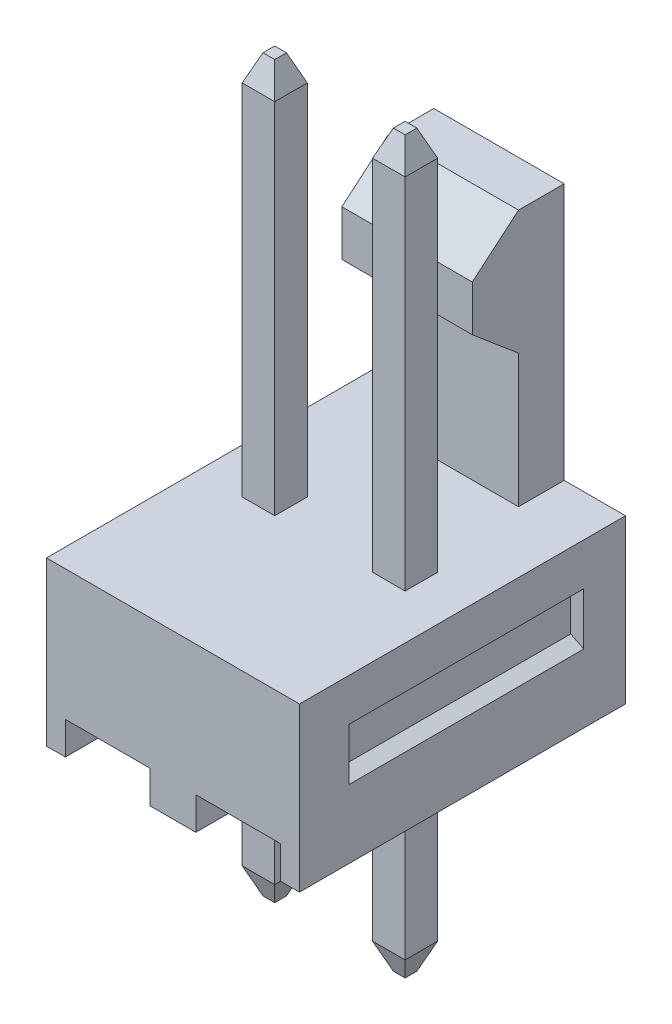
ISO-10303-21;
HEADER;
FILE_DESCRIPTION(('STEP AP214'),'2;1');
FILE_NAME('part.step','',(''),(''),'','','');
FILE_SCHEMA(('AUTOMOTIVE_DESIGN { 1 0 10303 214 1 1 1 1 }'));
ENDSEC;
DATA;
#1=APPLICATION_CONTEXT('core data for automotive mechanical design processes');
#2=APPLICATION_PROTOCOL_DEFINITION('international standard','automotive_design',2000,#1);
#3=PRODUCT_CONTEXT('',#1,'mechanical');
#4=PRODUCT('Part','Part','',(#3));
#5=PRODUCT_RELATED_PRODUCT_CATEGORY('part','',(#4));
#6=PRODUCT_DEFINITION_FORMATION('','',#4);
#7=PRODUCT_DEFINITION_CONTEXT('part definition',#1,'design');
#8=PRODUCT_DEFINITION('design','',#6,#7);
#9=PRODUCT_DEFINITION_SHAPE('','',#8);
#10=(LENGTH_UNIT() NAMED_UNIT(*) SI_UNIT(.MILLI.,.METRE.));
#11=(NAMED_UNIT(*) PLANE_ANGLE_UNIT() SI_UNIT($,.RADIAN.));
#12=(NAMED_UNIT(*) SI_UNIT($,.STERADIAN.) SOLID_ANGLE_UNIT());
#13=UNCERTAINTY_MEASURE_WITH_UNIT(LENGTH_MEASURE(1.E-05),#10,'distance_accuracy_value','');
#14=(GEOMETRIC_REPRESENTATION_CONTEXT(3) GLOBAL_UNCERTAINTY_ASSIGNED_CONTEXT((#13)) GLOBAL_UNIT_ASSIGNED_CONTEXT((#10,
#11,#12)) REPRESENTATION_CONTEXT('',''));
#15=CARTESIAN_POINT('',(0.,0.,0.));
#16=DIRECTION('',(0.,0.,1.));
#17=DIRECTION('',(1.,0.,0.));
#18=AXIS2_PLACEMENT_3D('',#15,#16,#17);
#19=CARTESIAN_POINT('',(-1.27,-4.8895,0.2159));
#20=DIRECTION('',(0.,-0.371390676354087,0.928476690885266));
#21=DIRECTION('',(0.,-0.928476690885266,-0.371390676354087));
#22=AXIS2_PLACEMENT_3D('',#19,#20,#21);
#23=PLANE('',#22);
#24=DIRECTION('',(-0.34815531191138,0.870388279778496,0.348155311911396));
#25=VECTOR('',#24,1.);
#26=CARTESIAN_POINT('',(-1.3843,-5.1435,0.1143));
#27=LINE('',#26,#25);
#28=CARTESIAN_POINT('',(-1.3843,-5.1435,0.114300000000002));
#29=VERTEX_POINT('',#28);
#30=CARTESIAN_POINT('',(-1.5875,-4.6355,0.317499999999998));
#31=VERTEX_POINT('',#30);
#32=EDGE_CURVE('E335',#29,#31,#27,.T.);
#33=ORIENTED_EDGE('',*,*,#32,.F.);
#34=DIRECTION('',(1.,0.,0.));
#35=VECTOR('',#34,1.);
#36=CARTESIAN_POINT('',(-0.9525,-5.1435,0.1143));
#37=LINE('',#36,#35);
#38=CARTESIAN_POINT('',(-1.1557,-5.1435,0.114300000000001));
#39=VERTEX_POINT('',#38);
#40=EDGE_CURVE('E350',#39,#29,#37,.F.);
#41=ORIENTED_EDGE('',*,*,#40,.F.);
#42=DIRECTION('',(-0.34815531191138,-0.870388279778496,-0.348155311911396));
#43=VECTOR('',#42,1.);
#44=CARTESIAN_POINT('',(-0.952500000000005,-4.6355,0.3175));
#45=LINE('',#44,#43);
#46=CARTESIAN_POINT('',(-0.952500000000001,-4.6355,0.317499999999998));
#47=VERTEX_POINT('',#46);
#48=EDGE_CURVE('E340',#47,#39,#45,.T.);
#49=ORIENTED_EDGE('',*,*,#48,.F.);
#50=DIRECTION('',(1.,0.,0.));
#51=VECTOR('',#50,1.);
#52=CARTESIAN_POINT('',(-0.9525,-4.6355,0.3175));
#53=LINE('',#52,#51);
#54=EDGE_CURVE('E348',#31,#47,#53,.T.);
#55=ORIENTED_EDGE('',*,*,#54,.F.);
#56=EDGE_LOOP('',(#33,#41,#49,#55));
#57=FACE_BOUND('',#56,.T.);
#58=ADVANCED_FACE('F16',(#57),#23,.T.);
#59=CARTESIAN_POINT('',(1.27,-4.8895,0.2159));
#60=DIRECTION('',(0.,-0.371390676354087,0.928476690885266));
#61=DIRECTION('',(0.,-0.928476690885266,-0.371390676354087));
#62=AXIS2_PLACEMENT_3D('',#59,#60,#61);
#63=PLANE('',#62);
#64=DIRECTION('',(-0.34815531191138,0.870388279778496,0.348155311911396));
#65=VECTOR('',#64,1.);
#66=CARTESIAN_POINT('',(1.1557,-5.1435,0.1143));
#67=LINE('',#66,#65);
#68=CARTESIAN_POINT('',(1.1557,-5.1435,0.114300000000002));
#69=VERTEX_POINT('',#68);
#70=CARTESIAN_POINT('',(0.9525,-4.6355,0.317499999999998));
#71=VERTEX_POINT('',#70);
#72=EDGE_CURVE('E387',#69,#71,#67,.T.);
#73=ORIENTED_EDGE('',*,*,#72,.F.);
#74=DIRECTION('',(1.,0.,0.));
#75=VECTOR('',#74,1.);
#76=CARTESIAN_POINT('',(1.5875,-5.1435,0.1143));
#77=LINE('',#76,#75);
#78=CARTESIAN_POINT('',(1.3843,-5.1435,0.114300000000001));
#79=VERTEX_POINT('',#78);
#80=EDGE_CURVE('E393',#79,#69,#77,.F.);
#81=ORIENTED_EDGE('',*,*,#80,.F.);
#82=DIRECTION('',(-0.34815531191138,-0.870388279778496,-0.348155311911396));
#83=VECTOR('',#82,1.);
#84=CARTESIAN_POINT('',(1.5875,-4.6355,0.3175));
#85=LINE('',#84,#83);
#86=CARTESIAN_POINT('',(1.5875,-4.6355,0.317499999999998));
#87=VERTEX_POINT('',#86);
#88=EDGE_CURVE('E399',#87,#79,#85,.T.);
#89=ORIENTED_EDGE('',*,*,#88,.F.);
#90=DIRECTION('',(1.,0.,0.));
#91=VECTOR('',#90,1.);
#92=CARTESIAN_POINT('',(1.5875,-4.6355,0.3175));
#93=LINE('',#92,#91);
#94=EDGE_CURVE('E401',#71,#87,#93,.T.);
#95=ORIENTED_EDGE('',*,*,#94,.F.);
#96=EDGE_LOOP('',(#73,#81,#89,#95));
#97=FACE_BOUND('',#96,.T.);
#98=ADVANCED_FACE('F1083',(#97),#63,.T.);
#99=CARTESIAN_POINT('',(-0.9525,-5.1435,0.3175));
#100=DIRECTION('',(0.,0.,1.));
#101=DIRECTION('',(1.,0.,0.));
#102=AXIS2_PLACEMENT_3D('',#99,#100,#101);
#103=PLANE('',#102);
#104=DIRECTION('',(0.,1.,0.));
#105=VECTOR('',#104,1.);
#106=CARTESIAN_POINT('',(-1.5875,-1.5875,0.3175));
#107=LINE('',#106,#105);
#108=CARTESIAN_POINT('',(-1.5875,-0.9525,0.3175));
#109=VERTEX_POINT('',#108);
#110=EDGE_CURVE('E367',#31,#109,#107,.T.);
#111=ORIENTED_EDGE('',*,*,#110,.F.);
#112=ORIENTED_EDGE('',*,*,#54,.T.);
#113=DIRECTION('',(0.,1.,0.));
#114=VECTOR('',#113,1.);
#115=CARTESIAN_POINT('',(-0.9525,-1.5875,0.3175));
#116=LINE('',#115,#114);
#117=CARTESIAN_POINT('',(-0.9525,-0.9525,0.3175));
#118=VERTEX_POINT('',#117);
#119=EDGE_CURVE('E368',#47,#118,#116,.T.);
#120=ORIENTED_EDGE('',*,*,#119,.T.);
#121=DIRECTION('',(1.,0.,0.));
#122=VECTOR('',#121,1.);
#123=CARTESIAN_POINT('',(-0.9525,-0.9525,0.3175));
#124=LINE('',#123,#122);
#125=EDGE_CURVE('E19',#118,#109,#124,.F.);
#126=ORIENTED_EDGE('',*,*,#125,.T.);
#127=EDGE_LOOP('',(#111,#112,#120,#126));
#128=FACE_BOUND('',#127,.T.);
#129=ADVANCED_FACE('F365',(#128),#103,.T.);
#130=CARTESIAN_POINT('',(-1.0541,-4.8895,0.));
#131=DIRECTION('',(0.928476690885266,-0.371390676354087,0.));
#132=DIRECTION('',(0.371390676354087,0.928476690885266,0.));
#133=AXIS2_PLACEMENT_3D('',#130,#131,#132);
#134=PLANE('',#133);
#135=ORIENTED_EDGE('',*,*,#48,.T.);
#136=DIRECTION('',(0.,0.,-1.));
#137=VECTOR('',#136,1.);
#138=CARTESIAN_POINT('',(-1.1557,-5.1435,-0.3175));
#139=LINE('',#138,#137);
#140=CARTESIAN_POINT('',(-1.1557,-5.1435,-0.114300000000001));
#141=VERTEX_POINT('',#140);
#142=EDGE_CURVE('E343',#141,#39,#139,.F.);
#143=ORIENTED_EDGE('',*,*,#142,.F.);
#144=DIRECTION('',(-0.348155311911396,-0.870388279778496,0.34815531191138));
#145=VECTOR('',#144,1.);
#146=CARTESIAN_POINT('',(-0.9525,-4.6355,-0.317499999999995));
#147=LINE('',#146,#145);
#148=CARTESIAN_POINT('',(-0.952500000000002,-4.6355,-0.317499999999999));
#149=VERTEX_POINT('',#148);
#150=EDGE_CURVE('E418',#149,#141,#147,.T.);
#151=ORIENTED_EDGE('',*,*,#150,.F.);
#152=DIRECTION('',(0.,0.,1.));
#153=VECTOR('',#152,1.);
#154=CARTESIAN_POINT('',(-0.9525,-4.6355,3.2512));
#155=LINE('',#154,#153);
#156=EDGE_CURVE('E346',#149,#47,#155,.T.);
#157=ORIENTED_EDGE('',*,*,#156,.T.);
#158=EDGE_LOOP('',(#135,#143,#151,#157));
#159=FACE_BOUND('',#158,.T.);
#160=ADVANCED_FACE('F341',(#159),#134,.T.);
#161=CARTESIAN_POINT('',(-0.9525,-5.1435,-0.3175));
#162=DIRECTION('',(0.,-1.,0.));
#163=DIRECTION('',(0.,0.,-1.));
#164=AXIS2_PLACEMENT_3D('',#161,#162,#163);
#165=PLANE('',#164);
#166=ORIENTED_EDGE('',*,*,#142,.T.);
#167=ORIENTED_EDGE('',*,*,#40,.T.);
#168=DIRECTION('',(0.,0.,1.));
#169=VECTOR('',#168,1.);
#170=CARTESIAN_POINT('',(-1.3843,-5.1435,0.));
#171=LINE('',#170,#169);
#172=CARTESIAN_POINT('',(-1.3843,-5.1435,-0.114300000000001));
#173=VERTEX_POINT('',#172);
#174=EDGE_CURVE('E406',#173,#29,#171,.T.);
#175=ORIENTED_EDGE('',*,*,#174,.F.);
#176=DIRECTION('',(1.,0.,0.));
#177=VECTOR('',#176,1.);
#178=CARTESIAN_POINT('',(-1.27,-5.1435,-0.114300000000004));
#179=LINE('',#178,#177);
#180=EDGE_CURVE('E356',#141,#173,#179,.F.);
#181=ORIENTED_EDGE('',*,*,#180,.F.);
#182=EDGE_LOOP('',(#166,#167,#175,#181));
#183=FACE_BOUND('',#182,.T.);
#184=ADVANCED_FACE('F354',(#183),#165,.T.);
#185=CARTESIAN_POINT('',(-1.4859,-4.8895,0.));
#186=DIRECTION('',(-0.928476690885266,-0.371390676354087,0.));
#187=DIRECTION('',(0.371390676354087,-0.928476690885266,0.));
#188=AXIS2_PLACEMENT_3D('',#185,#186,#187);
#189=PLANE('',#188);
#190=DIRECTION('',(-0.348155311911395,0.870388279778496,-0.34815531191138));
#191=VECTOR('',#190,1.);
#192=CARTESIAN_POINT('',(-1.3843,-5.1435,-0.114300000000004));
#193=LINE('',#192,#191);
#194=CARTESIAN_POINT('',(-1.5875,-4.6355,-0.3175));
#195=VERTEX_POINT('',#194);
#196=EDGE_CURVE('E411',#173,#195,#193,.T.);
#197=ORIENTED_EDGE('',*,*,#196,.F.);
#198=ORIENTED_EDGE('',*,*,#174,.T.);
#199=ORIENTED_EDGE('',*,*,#32,.T.);
#200=DIRECTION('',(0.,0.,1.));
#201=VECTOR('',#200,1.);
#202=CARTESIAN_POINT('',(-1.5875,-4.6355,3.2512));
#203=LINE('',#202,#201);
#204=EDGE_CURVE('E380',#195,#31,#203,.T.);
#205=ORIENTED_EDGE('',*,*,#204,.F.);
#206=EDGE_LOOP('',(#197,#198,#199,#205));
#207=FACE_BOUND('',#206,.T.);
#208=ADVANCED_FACE('F409',(#207),#189,.T.);
#209=CARTESIAN_POINT('',(1.5875,-5.1435,0.3175));
#210=DIRECTION('',(0.,0.,1.));
#211=DIRECTION('',(1.,0.,0.));
#212=AXIS2_PLACEMENT_3D('',#209,#210,#211);
#213=PLANE('',#212);
#214=DIRECTION('',(0.,1.,0.));
#215=VECTOR('',#214,1.);
#216=CARTESIAN_POINT('',(0.9525,-1.5875,0.3175));
#217=LINE('',#216,#215);
#218=CARTESIAN_POINT('',(0.9525,-0.9525,0.3175));
#219=VERTEX_POINT('',#218);
#220=EDGE_CURVE('E496',#71,#219,#217,.T.);
#221=ORIENTED_EDGE('',*,*,#220,.F.);
#222=ORIENTED_EDGE('',*,*,#94,.T.);
#223=DIRECTION('',(0.,1.,0.));
#224=VECTOR('',#223,1.);
#225=CARTESIAN_POINT('',(1.5875,-1.5875,0.3175));
#226=LINE('',#225,#224);
#227=CARTESIAN_POINT('',(1.5875,-0.9525,0.3175));
#228=VERTEX_POINT('',#227);
#229=EDGE_CURVE('E485',#87,#228,#226,.T.);
#230=ORIENTED_EDGE('',*,*,#229,.T.);
#231=DIRECTION('',(1.,0.,0.));
#232=VECTOR('',#231,1.);
#233=CARTESIAN_POINT('',(1.5875,-0.9525,0.3175));
#234=LINE('',#233,#232);
#235=EDGE_CURVE('E404',#228,#219,#234,.F.);
#236=ORIENTED_EDGE('',*,*,#235,.T.);
#237=EDGE_LOOP('',(#221,#222,#230,#236));
#238=FACE_BOUND('',#237,.T.);
#239=ADVANCED_FACE('F1071',(#238),#213,.T.);
#240=CARTESIAN_POINT('',(1.4859,-4.8895,0.));
#241=DIRECTION('',(0.928476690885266,-0.371390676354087,0.));
#242=DIRECTION('',(0.371390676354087,0.928476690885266,0.));
#243=AXIS2_PLACEMENT_3D('',#240,#241,#242);
#244=PLANE('',#243);
#245=ORIENTED_EDGE('',*,*,#88,.T.);
#246=DIRECTION('',(0.,0.,-1.));
#247=VECTOR('',#246,1.);
#248=CARTESIAN_POINT('',(1.3843,-5.1435,-0.3175));
#249=LINE('',#248,#247);
#250=CARTESIAN_POINT('',(1.3843,-5.1435,-0.114300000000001));
#251=VERTEX_POINT('',#250);
#252=EDGE_CURVE('E396',#251,#79,#249,.F.);
#253=ORIENTED_EDGE('',*,*,#252,.F.);
#254=DIRECTION('',(-0.348155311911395,-0.870388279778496,0.34815531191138));
#255=VECTOR('',#254,1.);
#256=CARTESIAN_POINT('',(1.5875,-4.6355,-0.317499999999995));
#257=LINE('',#256,#255);
#258=CARTESIAN_POINT('',(1.5875,-4.6355,-0.3175));
#259=VERTEX_POINT('',#258);
#260=EDGE_CURVE('E480',#259,#251,#257,.T.);
#261=ORIENTED_EDGE('',*,*,#260,.F.);
#262=DIRECTION('',(0.,0.,1.));
#263=VECTOR('',#262,1.);
#264=CARTESIAN_POINT('',(1.5875,-4.6355,3.2512));
#265=LINE('',#264,#263);
#266=EDGE_CURVE('E488',#259,#87,#265,.T.);
#267=ORIENTED_EDGE('',*,*,#266,.T.);
#268=EDGE_LOOP('',(#245,#253,#261,#267));
#269=FACE_BOUND('',#268,.T.);
#270=ADVANCED_FACE('F1067',(#269),#244,.T.);
#271=CARTESIAN_POINT('',(1.5875,-5.1435,-0.3175));
#272=DIRECTION('',(0.,-1.,0.));
#273=DIRECTION('',(0.,0.,-1.));
#274=AXIS2_PLACEMENT_3D('',#271,#272,#273);
#275=PLANE('',#274);
#276=ORIENTED_EDGE('',*,*,#252,.T.);
#277=ORIENTED_EDGE('',*,*,#80,.T.);
#278=DIRECTION('',(0.,0.,1.));
#279=VECTOR('',#278,1.);
#280=CARTESIAN_POINT('',(1.1557,-5.1435,0.));
#281=LINE('',#280,#279);
#282=CARTESIAN_POINT('',(1.1557,-5.1435,-0.114300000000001));
#283=VERTEX_POINT('',#282);
#284=EDGE_CURVE('E384',#283,#69,#281,.T.);
#285=ORIENTED_EDGE('',*,*,#284,.F.);
#286=DIRECTION('',(1.,0.,0.));
#287=VECTOR('',#286,1.);
#288=CARTESIAN_POINT('',(1.27,-5.1435,-0.114300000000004));
#289=LINE('',#288,#287);
#290=EDGE_CURVE('E477',#251,#283,#289,.F.);
#291=ORIENTED_EDGE('',*,*,#290,.F.);
#292=EDGE_LOOP('',(#276,#277,#285,#291));
#293=FACE_BOUND('',#292,.T.);
#294=ADVANCED_FACE('F1063',(#293),#275,.T.);
#295=CARTESIAN_POINT('',(1.0541,-4.8895,0.));
#296=DIRECTION('',(-0.928476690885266,-0.371390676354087,0.));
#297=DIRECTION('',(0.371390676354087,-0.928476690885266,0.));
#298=AXIS2_PLACEMENT_3D('',#295,#296,#297);
#299=PLANE('',#298);
#300=DIRECTION('',(-0.348155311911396,0.870388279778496,-0.34815531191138));
#301=VECTOR('',#300,1.);
#302=CARTESIAN_POINT('',(1.1557,-5.1435,-0.114300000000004));
#303=LINE('',#302,#301);
#304=CARTESIAN_POINT('',(0.952500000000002,-4.6355,-0.317499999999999));
#305=VERTEX_POINT('',#304);
#306=EDGE_CURVE('E474',#283,#305,#303,.T.);
#307=ORIENTED_EDGE('',*,*,#306,.F.);
#308=ORIENTED_EDGE('',*,*,#284,.T.);
#309=ORIENTED_EDGE('',*,*,#72,.T.);
#310=DIRECTION('',(0.,0.,1.));
#311=VECTOR('',#310,1.);
#312=CARTESIAN_POINT('',(0.9525,-4.6355,3.2512));
#313=LINE('',#312,#311);
#314=EDGE_CURVE('E491',#305,#71,#313,.T.);
#315=ORIENTED_EDGE('',*,*,#314,.F.);
#316=EDGE_LOOP('',(#307,#308,#309,#315));
#317=FACE_BOUND('',#316,.T.);
#318=ADVANCED_FACE('F1060',(#317),#299,.T.);
#319=CARTESIAN_POINT('',(-1.5875,-1.5875,3.2512));
#320=DIRECTION('',(-1.,0.,0.));
#321=DIRECTION('',(0.,0.,1.));
#322=AXIS2_PLACEMENT_3D('',#319,#320,#321);
#323=PLANE('',#322);
#324=DIRECTION('',(0.,1.,0.));
#325=VECTOR('',#324,1.);
#326=CARTESIAN_POINT('',(-1.5875,-0.9525,-0.3175));
#327=LINE('',#326,#325);
#328=CARTESIAN_POINT('',(-1.5875,-0.9525,-0.3175));
#329=VERTEX_POINT('',#328);
#330=EDGE_CURVE('E433',#195,#329,#327,.T.);
#331=ORIENTED_EDGE('',*,*,#330,.F.);
#332=ORIENTED_EDGE('',*,*,#204,.T.);
#333=ORIENTED_EDGE('',*,*,#110,.T.);
#334=DIRECTION('',(0.,0.,1.));
#335=VECTOR('',#334,1.);
#336=CARTESIAN_POINT('',(-1.5875,-0.9525,3.2512));
#337=LINE('',#336,#335);
#338=EDGE_CURVE('E372',#109,#329,#337,.F.);
#339=ORIENTED_EDGE('',*,*,#338,.T.);
#340=EDGE_LOOP('',(#331,#332,#333,#339));
#341=FACE_BOUND('',#340,.T.);
#342=ADVANCED_FACE('F383',(#341),#323,.T.);
#343=CARTESIAN_POINT('',(-0.9525,-1.5875,3.2512));
#344=DIRECTION('',(-1.,0.,0.));
#345=DIRECTION('',(0.,0.,1.));
#346=AXIS2_PLACEMENT_3D('',#343,#344,#345);
#347=PLANE('',#346);
#348=DIRECTION('',(0.,0.,1.));
#349=VECTOR('',#348,1.);
#350=CARTESIAN_POINT('',(-0.9525,-0.9525,3.2512));
#351=LINE('',#350,#349);
#352=CARTESIAN_POINT('',(-0.9525,-0.9525,-0.3175));
#353=VERTEX_POINT('',#352);
#354=EDGE_CURVE('E420',#118,#353,#351,.F.);
#355=ORIENTED_EDGE('',*,*,#354,.F.);
#356=ORIENTED_EDGE('',*,*,#119,.F.);
#357=ORIENTED_EDGE('',*,*,#156,.F.);
#358=DIRECTION('',(0.,1.,0.));
#359=VECTOR('',#358,1.);
#360=CARTESIAN_POINT('',(-0.9525,-0.9525,-0.3175));
#361=LINE('',#360,#359);
#362=EDGE_CURVE('E429',#353,#149,#361,.F.);
#363=ORIENTED_EDGE('',*,*,#362,.F.);
#364=EDGE_LOOP('',(#355,#356,#357,#363));
#365=FACE_BOUND('',#364,.T.);
#366=ADVANCED_FACE('F430',(#365),#347,.F.);
#367=CARTESIAN_POINT('',(-1.27,-4.8895,-0.2159));
#368=DIRECTION('',(0.,-0.371390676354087,-0.928476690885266));
#369=DIRECTION('',(0.,0.928476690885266,-0.371390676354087));
#370=AXIS2_PLACEMENT_3D('',#367,#368,#369);
#371=PLANE('',#370);
#372=ORIENTED_EDGE('',*,*,#196,.T.);
#373=DIRECTION('',(-1.,0.,0.));
#374=VECTOR('',#373,1.);
#375=CARTESIAN_POINT('',(-0.9525,-4.6355,-0.3175));
#376=LINE('',#375,#374);
#377=EDGE_CURVE('E432',#149,#195,#376,.T.);
#378=ORIENTED_EDGE('',*,*,#377,.F.);
#379=ORIENTED_EDGE('',*,*,#150,.T.);
#380=ORIENTED_EDGE('',*,*,#180,.T.);
#381=EDGE_LOOP('',(#372,#378,#379,#380));
#382=FACE_BOUND('',#381,.T.);
#383=ADVANCED_FACE('F417',(#382),#371,.T.);
#384=CARTESIAN_POINT('',(-2.4638,-1.5875,3.2512));
#385=DIRECTION('',(0.,-1.,0.));
#386=DIRECTION('',(0.,0.,-1.));
#387=AXIS2_PLACEMENT_3D('',#384,#385,#386);
#388=PLANE('',#387);
#389=DIRECTION('',(1.,0.,0.));
#390=VECTOR('',#389,1.);
#391=CARTESIAN_POINT('',(-2.4638,-1.5875,-3.0988));
#392=LINE('',#391,#390);
#393=CARTESIAN_POINT('',(-0.4445,-1.5875,-3.0988));
#394=VERTEX_POINT('',#393);
#395=CARTESIAN_POINT('',(0.4445,-1.5875,-3.0988));
#396=VERTEX_POINT('',#395);
#397=EDGE_CURVE('E499',#394,#396,#392,.T.);
#398=ORIENTED_EDGE('',*,*,#397,.T.);
#399=DIRECTION('',(0.,0.,1.));
#400=VECTOR('',#399,1.);
#401=CARTESIAN_POINT('',(0.4445,-1.5875,3.2512));
#402=LINE('',#401,#400);
#403=CARTESIAN_POINT('',(0.4445,-1.5875,3.2512));
#404=VERTEX_POINT('',#403);
#405=EDGE_CURVE('E458',#396,#404,#402,.T.);
#406=ORIENTED_EDGE('',*,*,#405,.T.);
#407=DIRECTION('',(1.,0.,0.));
#408=VECTOR('',#407,1.);
#409=CARTESIAN_POINT('',(-2.4638,-1.5875,3.2512));
#410=LINE('',#409,#408);
#411=CARTESIAN_POINT('',(-0.4445,-1.5875,3.2512));
#412=VERTEX_POINT('',#411);
#413=EDGE_CURVE('E415',#404,#412,#410,.F.);
#414=ORIENTED_EDGE('',*,*,#413,.T.);
#415=DIRECTION('',(0.,0.,-1.));
#416=VECTOR('',#415,1.);
#417=CARTESIAN_POINT('',(-0.4445,-1.5875,3.2512));
#418=LINE('',#417,#416);
#419=EDGE_CURVE('E469',#412,#394,#418,.T.);
#420=ORIENTED_EDGE('',*,*,#419,.T.);
#421=EDGE_LOOP('',(#398,#406,#414,#420));
#422=FACE_BOUND('',#421,.T.);
#423=ADVANCED_FACE('F504',(#422),#388,.T.);
#424=CARTESIAN_POINT('',(0.9525,-1.5875,3.2512));
#425=DIRECTION('',(-1.,0.,0.));
#426=DIRECTION('',(0.,0.,1.));
#427=AXIS2_PLACEMENT_3D('',#424,#425,#426);
#428=PLANE('',#427);
#429=DIRECTION('',(0.,1.,0.));
#430=VECTOR('',#429,1.);
#431=CARTESIAN_POINT('',(0.9525,-0.9525,-0.3175));
#432=LINE('',#431,#430);
#433=CARTESIAN_POINT('',(0.9525,-0.9525,-0.3175));
#434=VERTEX_POINT('',#433);
#435=EDGE_CURVE('E455',#305,#434,#432,.T.);
#436=ORIENTED_EDGE('',*,*,#435,.F.);
#437=ORIENTED_EDGE('',*,*,#314,.T.);
#438=ORIENTED_EDGE('',*,*,#220,.T.);
#439=DIRECTION('',(0.,0.,1.));
#440=VECTOR('',#439,1.);
#441=CARTESIAN_POINT('',(0.9525,-0.9525,3.2512));
#442=LINE('',#441,#440);
#443=EDGE_CURVE('E494',#219,#434,#442,.F.);
#444=ORIENTED_EDGE('',*,*,#443,.T.);
#445=EDGE_LOOP('',(#436,#437,#438,#444));
#446=FACE_BOUND('',#445,.T.);
#447=ADVANCED_FACE('F1047',(#446),#428,.T.);
#448=CARTESIAN_POINT('',(1.5875,-1.5875,3.2512));
#449=DIRECTION('',(-1.,0.,0.));
#450=DIRECTION('',(0.,0.,1.));
#451=AXIS2_PLACEMENT_3D('',#448,#449,#450);
#452=PLANE('',#451);
#453=DIRECTION('',(0.,0.,1.));
#454=VECTOR('',#453,1.);
#455=CARTESIAN_POINT('',(1.5875,-0.9525,3.2512));
#456=LINE('',#455,#454);
#457=CARTESIAN_POINT('',(1.5875,-0.9525,-0.3175));
#458=VERTEX_POINT('',#457);
#459=EDGE_CURVE('E483',#228,#458,#456,.F.);
#460=ORIENTED_EDGE('',*,*,#459,.F.);
#461=ORIENTED_EDGE('',*,*,#229,.F.);
#462=ORIENTED_EDGE('',*,*,#266,.F.);
#463=DIRECTION('',(0.,1.,0.));
#464=VECTOR('',#463,1.);
#465=CARTESIAN_POINT('',(1.5875,-0.9525,-0.3175));
#466=LINE('',#465,#464);
#467=EDGE_CURVE('E452',#458,#259,#466,.F.);
#468=ORIENTED_EDGE('',*,*,#467,.F.);
#469=EDGE_LOOP('',(#460,#461,#462,#468));
#470=FACE_BOUND('',#469,.T.);
#471=ADVANCED_FACE('F1043',(#470),#452,.F.);
#472=CARTESIAN_POINT('',(1.27,-4.8895,-0.2159));
#473=DIRECTION('',(0.,-0.371390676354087,-0.928476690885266));
#474=DIRECTION('',(0.,0.928476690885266,-0.371390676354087));
#475=AXIS2_PLACEMENT_3D('',#472,#473,#474);
#476=PLANE('',#475);
#477=ORIENTED_EDGE('',*,*,#306,.T.);
#478=DIRECTION('',(-1.,0.,0.));
#479=VECTOR('',#478,1.);
#480=CARTESIAN_POINT('',(1.5875,-4.6355,-0.3175));
#481=LINE('',#480,#479);
#482=EDGE_CURVE('E449',#259,#305,#481,.T.);
#483=ORIENTED_EDGE('',*,*,#482,.F.);
#484=ORIENTED_EDGE('',*,*,#260,.T.);
#485=ORIENTED_EDGE('',*,*,#290,.T.);
#486=EDGE_LOOP('',(#477,#483,#484,#485));
#487=FACE_BOUND('',#486,.T.);
#488=ADVANCED_FACE('F1040',(#487),#476,.T.);
#489=CARTESIAN_POINT('',(-0.4445,-1.5875,3.2512));
#490=DIRECTION('',(1.,0.,0.));
#491=DIRECTION('',(0.,0.,-1.));
#492=AXIS2_PLACEMENT_3D('',#489,#490,#491);
#493=PLANE('',#492);
#494=DIRECTION('',(0.,1.,0.));
#495=VECTOR('',#494,1.);
#496=CARTESIAN_POINT('',(-0.4445,-1.5875,-3.0988));
#497=LINE('',#496,#495);
#498=CARTESIAN_POINT('',(-0.4445,-0.9525,-3.0988));
#499=VERTEX_POINT('',#498);
#500=EDGE_CURVE('E467',#394,#499,#497,.T.);
#501=ORIENTED_EDGE('',*,*,#500,.F.);
#502=ORIENTED_EDGE('',*,*,#419,.F.);
#503=DIRECTION('',(0.,1.,0.));
#504=VECTOR('',#503,1.);
#505=CARTESIAN_POINT('',(-0.4445,-1.5875,3.2512));
#506=LINE('',#505,#504);
#507=CARTESIAN_POINT('',(-0.4445,-0.9525,3.2512));
#508=VERTEX_POINT('',#507);
#509=EDGE_CURVE('E472',#508,#412,#506,.F.);
#510=ORIENTED_EDGE('',*,*,#509,.F.);
#511=DIRECTION('',(0.,0.,1.));
#512=VECTOR('',#511,1.);
#513=CARTESIAN_POINT('',(-0.4445,-0.9525,3.2512));
#514=LINE('',#513,#512);
#515=EDGE_CURVE('E441',#508,#499,#514,.F.);
#516=ORIENTED_EDGE('',*,*,#515,.T.);
#517=EDGE_LOOP('',(#501,#502,#510,#516));
#518=FACE_BOUND('',#517,.T.);
#519=ADVANCED_FACE('F511',(#518),#493,.F.);
#520=CARTESIAN_POINT('',(-0.9525,-0.9525,-0.3175));
#521=DIRECTION('',(0.,0.,-1.));
#522=DIRECTION('',(-1.,0.,0.));
#523=AXIS2_PLACEMENT_3D('',#520,#521,#522);
#524=PLANE('',#523);
#525=ORIENTED_EDGE('',*,*,#362,.T.);
#526=ORIENTED_EDGE('',*,*,#377,.T.);
#527=ORIENTED_EDGE('',*,*,#330,.T.);
#528=DIRECTION('',(1.,0.,0.));
#529=VECTOR('',#528,1.);
#530=CARTESIAN_POINT('',(-0.4445,-0.9525,-0.3175));
#531=LINE('',#530,#529);
#532=EDGE_CURVE('E376',#329,#353,#531,.T.);
#533=ORIENTED_EDGE('',*,*,#532,.T.);
#534=EDGE_LOOP('',(#525,#526,#527,#533));
#535=FACE_BOUND('',#534,.T.);
#536=ADVANCED_FACE('F435',(#535),#524,.T.);
#537=CARTESIAN_POINT('',(0.4445,-0.9525,3.2512));
#538=DIRECTION('',(-1.,0.,0.));
#539=DIRECTION('',(0.,0.,1.));
#540=AXIS2_PLACEMENT_3D('',#537,#538,#539);
#541=PLANE('',#540);
#542=DIRECTION('',(0.,1.,0.));
#543=VECTOR('',#542,1.);
#544=CARTESIAN_POINT('',(0.4445,-0.9525,-3.0988));
#545=LINE('',#544,#543);
#546=CARTESIAN_POINT('',(0.4445,-0.9525,-3.0988));
#547=VERTEX_POINT('',#546);
#548=EDGE_CURVE('E461',#547,#396,#545,.F.);
#549=ORIENTED_EDGE('',*,*,#548,.F.);
#550=DIRECTION('',(0.,0.,1.));
#551=VECTOR('',#550,1.);
#552=CARTESIAN_POINT('',(0.4445,-0.9525,3.2512));
#553=LINE('',#552,#551);
#554=CARTESIAN_POINT('',(0.4445,-0.9525,3.2512));
#555=VERTEX_POINT('',#554);
#556=EDGE_CURVE('E522',#547,#555,#553,.T.);
#557=ORIENTED_EDGE('',*,*,#556,.T.);
#558=DIRECTION('',(0.,1.,0.));
#559=VECTOR('',#558,1.);
#560=CARTESIAN_POINT('',(0.4445,-0.9525,3.2512));
#561=LINE('',#560,#559);
#562=EDGE_CURVE('E463',#404,#555,#561,.T.);
#563=ORIENTED_EDGE('',*,*,#562,.F.);
#564=ORIENTED_EDGE('',*,*,#405,.F.);
#565=EDGE_LOOP('',(#549,#557,#563,#564));
#566=FACE_BOUND('',#565,.T.);
#567=ADVANCED_FACE('F519',(#566),#541,.F.);
#568=CARTESIAN_POINT('',(1.5875,-0.9525,-0.3175));
#569=DIRECTION('',(0.,0.,-1.));
#570=DIRECTION('',(-1.,0.,0.));
#571=AXIS2_PLACEMENT_3D('',#568,#569,#570);
#572=PLANE('',#571);
#573=ORIENTED_EDGE('',*,*,#467,.T.);
#574=ORIENTED_EDGE('',*,*,#482,.T.);
#575=ORIENTED_EDGE('',*,*,#435,.T.);
#576=DIRECTION('',(1.,0.,0.));
#577=VECTOR('',#576,1.);
#578=CARTESIAN_POINT('',(2.0955,-0.9525,-0.3175));
#579=LINE('',#578,#577);
#580=EDGE_CURVE('E556',#434,#458,#579,.T.);
#581=ORIENTED_EDGE('',*,*,#580,.T.);
#582=EDGE_LOOP('',(#573,#574,#575,#581));
#583=FACE_BOUND('',#582,.T.);
#584=ADVANCED_FACE('F1030',(#583),#572,.T.);
#585=CARTESIAN_POINT('',(-0.4445,-0.9525,3.2512));
#586=DIRECTION('',(0.,1.,0.));
#587=DIRECTION('',(0.,0.,1.));
#588=AXIS2_PLACEMENT_3D('',#585,#586,#587);
#589=PLANE('',#588);
#590=ORIENTED_EDGE('',*,*,#338,.F.);
#591=ORIENTED_EDGE('',*,*,#125,.F.);
#592=ORIENTED_EDGE('',*,*,#354,.T.);
#593=ORIENTED_EDGE('',*,*,#532,.F.);
#594=EDGE_LOOP('',(#590,#591,#592,#593));
#595=FACE_BOUND('',#594,.T.);
#596=DIRECTION('',(1.,0.,0.));
#597=VECTOR('',#596,1.);
#598=CARTESIAN_POINT('',(-0.4445,-0.9525,-3.0988));
#599=LINE('',#598,#597);
#600=CARTESIAN_POINT('',(-2.0955,-0.9525,-3.0988));
#601=VERTEX_POINT('',#600);
#602=EDGE_CURVE('E437',#499,#601,#599,.F.);
#603=ORIENTED_EDGE('',*,*,#602,.F.);
#604=ORIENTED_EDGE('',*,*,#515,.F.);
#605=DIRECTION('',(1.,0.,0.));
#606=VECTOR('',#605,1.);
#607=CARTESIAN_POINT('',(-0.4445,-0.9525,3.2512));
#608=LINE('',#607,#606);
#609=CARTESIAN_POINT('',(-2.0955,-0.9525,3.2512));
#610=VERTEX_POINT('',#609);
#611=EDGE_CURVE('E447',#610,#508,#608,.T.);
#612=ORIENTED_EDGE('',*,*,#611,.F.);
#613=DIRECTION('',(0.,0.,1.));
#614=VECTOR('',#613,1.);
#615=CARTESIAN_POINT('',(-2.0955,-0.9525,3.2512));
#616=LINE('',#615,#614);
#617=EDGE_CURVE('E546',#610,#601,#616,.F.);
#618=ORIENTED_EDGE('',*,*,#617,.T.);
#619=EDGE_LOOP('',(#603,#604,#612,#618));
#620=FACE_BOUND('',#619,.T.);
#621=ADVANCED_FACE('F373',(#595,#620),#589,.F.);
#622=CARTESIAN_POINT('',(2.0955,-0.9525,3.2512));
#623=DIRECTION('',(0.,1.,0.));
#624=DIRECTION('',(0.,0.,1.));
#625=AXIS2_PLACEMENT_3D('',#622,#623,#624);
#626=PLANE('',#625);
#627=ORIENTED_EDGE('',*,*,#443,.F.);
#628=ORIENTED_EDGE('',*,*,#235,.F.);
#629=ORIENTED_EDGE('',*,*,#459,.T.);
#630=ORIENTED_EDGE('',*,*,#580,.F.);
#631=EDGE_LOOP('',(#627,#628,#629,#630));
#632=FACE_BOUND('',#631,.T.);
#633=DIRECTION('',(1.,0.,0.));
#634=VECTOR('',#633,1.);
#635=CARTESIAN_POINT('',(2.0955,-0.9525,-3.0988));
#636=LINE('',#635,#634);
#637=CARTESIAN_POINT('',(2.0955,-0.9525,-3.0988));
#638=VERTEX_POINT('',#637);
#639=EDGE_CURVE('E439',#638,#547,#636,.F.);
#640=ORIENTED_EDGE('',*,*,#639,.F.);
#641=DIRECTION('',(0.,0.,-1.));
#642=VECTOR('',#641,1.);
#643=CARTESIAN_POINT('',(2.0955,-0.9525,3.2512));
#644=LINE('',#643,#642);
#645=CARTESIAN_POINT('',(2.0955,-0.9525,3.2512));
#646=VERTEX_POINT('',#645);
#647=EDGE_CURVE('E533',#638,#646,#644,.F.);
#648=ORIENTED_EDGE('',*,*,#647,.T.);
#649=DIRECTION('',(1.,0.,0.));
#650=VECTOR('',#649,1.);
#651=CARTESIAN_POINT('',(2.0955,-0.9525,3.2512));
#652=LINE('',#651,#650);
#653=EDGE_CURVE('E436',#555,#646,#652,.T.);
#654=ORIENTED_EDGE('',*,*,#653,.F.);
#655=ORIENTED_EDGE('',*,*,#556,.F.);
#656=EDGE_LOOP('',(#640,#648,#654,#655));
#657=FACE_BOUND('',#656,.T.);
#658=ADVANCED_FACE('F534',(#632,#657),#626,.F.);
#659=CARTESIAN_POINT('',(-1.27,6.5913,-2.2098));
#660=DIRECTION('',(0.,0.763794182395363,0.645459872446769));
#661=DIRECTION('',(0.,-0.645459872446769,0.763794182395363));
#662=AXIS2_PLACEMENT_3D('',#659,#660,#661);
#663=PLANE('',#662);
#664=DIRECTION('',(1.,0.,0.));
#665=VECTOR('',#664,1.);
#666=CARTESIAN_POINT('',(-1.27,6.5913,-2.2098));
#667=LINE('',#666,#665);
#668=CARTESIAN_POINT('',(-1.27,6.5913,-2.2098));
#669=VERTEX_POINT('',#668);
#670=CARTESIAN_POINT('',(1.27,6.5913,-2.2098));
#671=VERTEX_POINT('',#670);
#672=EDGE_CURVE('E536',#669,#671,#667,.T.);
#673=ORIENTED_EDGE('',*,*,#672,.F.);
#674=DIRECTION('',(0.,-0.645459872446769,0.763794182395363));
#675=VECTOR('',#674,1.);
#676=CARTESIAN_POINT('',(-1.27,6.5913,-2.2098));
#677=LINE('',#676,#675);
#678=CARTESIAN_POINT('',(-1.27,5.82930000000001,-1.3081));
#679=VERTEX_POINT('',#678);
#680=EDGE_CURVE('E552',#669,#679,#677,.T.);
#681=ORIENTED_EDGE('',*,*,#680,.T.);
#682=DIRECTION('',(1.,0.,0.));
#683=VECTOR('',#682,1.);
#684=CARTESIAN_POINT('',(-1.27,5.8293,-1.3081));
#685=LINE('',#684,#683);
#686=CARTESIAN_POINT('',(1.27,5.82930000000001,-1.3081));
#687=VERTEX_POINT('',#686);
#688=EDGE_CURVE('E635',#687,#679,#685,.F.);
#689=ORIENTED_EDGE('',*,*,#688,.F.);
#690=DIRECTION('',(0.,-0.645459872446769,0.763794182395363));
#691=VECTOR('',#690,1.);
#692=CARTESIAN_POINT('',(1.27,6.5913,-2.2098));
#693=LINE('',#692,#691);
#694=EDGE_CURVE('E554',#687,#671,#693,.F.);
#695=ORIENTED_EDGE('',*,*,#694,.T.);
#696=EDGE_LOOP('',(#673,#681,#689,#695));
#697=FACE_BOUND('',#696,.T.);
#698=ADVANCED_FACE('F653',(#697),#663,.T.);
#699=CARTESIAN_POINT('',(-1.4859,8.8265,0.));
#700=DIRECTION('',(-0.928476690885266,0.371390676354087,0.));
#701=DIRECTION('',(-0.371390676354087,-0.928476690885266,0.));
#702=AXIS2_PLACEMENT_3D('',#699,#700,#701);
#703=PLANE('',#702);
#704=DIRECTION('',(-0.348155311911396,-0.870388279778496,0.34815531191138));
#705=VECTOR('',#704,1.);
#706=CARTESIAN_POINT('',(-1.3843,9.0805,0.114300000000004));
#707=LINE('',#706,#705);
#708=CARTESIAN_POINT('',(-1.3843,9.0805,0.114300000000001));
#709=VERTEX_POINT('',#708);
#710=CARTESIAN_POINT('',(-1.5875,8.5725,0.3175));
#711=VERTEX_POINT('',#710);
#712=EDGE_CURVE('E615',#709,#711,#707,.T.);
#713=ORIENTED_EDGE('',*,*,#712,.F.);
#714=DIRECTION('',(0.,0.,1.));
#715=VECTOR('',#714,1.);
#716=CARTESIAN_POINT('',(-1.3843,9.0805,0.3175));
#717=LINE('',#716,#715);
#718=CARTESIAN_POINT('',(-1.3843,9.0805,-0.114300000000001));
#719=VERTEX_POINT('',#718);
#720=EDGE_CURVE('E631',#719,#709,#717,.T.);
#721=ORIENTED_EDGE('',*,*,#720,.F.);
#722=DIRECTION('',(0.348155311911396,0.870388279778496,0.34815531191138));
#723=VECTOR('',#722,1.);
#724=CARTESIAN_POINT('',(-1.5875,8.5725,-0.317499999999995));
#725=LINE('',#724,#723);
#726=CARTESIAN_POINT('',(-1.5875,8.5725,-0.317499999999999));
#727=VERTEX_POINT('',#726);
#728=EDGE_CURVE('E628',#727,#719,#725,.T.);
#729=ORIENTED_EDGE('',*,*,#728,.F.);
#730=DIRECTION('',(0.,0.,1.));
#731=VECTOR('',#730,1.);
#732=CARTESIAN_POINT('',(-1.5875,8.5725,3.2512));
#733=LINE('',#732,#731);
#734=EDGE_CURVE('E621',#711,#727,#733,.F.);
#735=ORIENTED_EDGE('',*,*,#734,.F.);
#736=EDGE_LOOP('',(#713,#721,#729,#735));
#737=FACE_BOUND('',#736,.T.);
#738=ADVANCED_FACE('F879',(#737),#703,.T.);
#739=CARTESIAN_POINT('',(1.0541,8.8265,0.));
#740=DIRECTION('',(-0.928476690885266,0.371390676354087,0.));
#741=DIRECTION('',(-0.371390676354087,-0.928476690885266,0.));
#742=AXIS2_PLACEMENT_3D('',#739,#740,#741);
#743=PLANE('',#742);
#744=DIRECTION('',(-0.348155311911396,-0.870388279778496,0.34815531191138));
#745=VECTOR('',#744,1.);
#746=CARTESIAN_POINT('',(1.1557,9.0805,0.114300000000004));
#747=LINE('',#746,#745);
#748=CARTESIAN_POINT('',(1.1557,9.0805,0.114300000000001));
#749=VERTEX_POINT('',#748);
#750=CARTESIAN_POINT('',(0.952500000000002,8.5725,0.3175));
#751=VERTEX_POINT('',#750);
#752=EDGE_CURVE('E597',#749,#751,#747,.T.);
#753=ORIENTED_EDGE('',*,*,#752,.F.);
#754=DIRECTION('',(0.,0.,1.));
#755=VECTOR('',#754,1.);
#756=CARTESIAN_POINT('',(1.1557,9.0805,0.3175));
#757=LINE('',#756,#755);
#758=CARTESIAN_POINT('',(1.1557,9.0805,-0.114300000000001));
#759=VERTEX_POINT('',#758);
#760=EDGE_CURVE('E613',#759,#749,#757,.T.);
#761=ORIENTED_EDGE('',*,*,#760,.F.);
#762=DIRECTION('',(0.348155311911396,0.870388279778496,0.34815531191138));
#763=VECTOR('',#762,1.);
#764=CARTESIAN_POINT('',(0.9525,8.5725,-0.317499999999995));
#765=LINE('',#764,#763);
#766=CARTESIAN_POINT('',(0.952500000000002,8.5725,-0.317499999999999));
#767=VERTEX_POINT('',#766);
#768=EDGE_CURVE('E610',#767,#759,#765,.T.);
#769=ORIENTED_EDGE('',*,*,#768,.F.);
#770=DIRECTION('',(0.,0.,1.));
#771=VECTOR('',#770,1.);
#772=CARTESIAN_POINT('',(0.9525,8.5725,3.2512));
#773=LINE('',#772,#771);
#774=EDGE_CURVE('E603',#751,#767,#773,.F.);
#775=ORIENTED_EDGE('',*,*,#774,.F.);
#776=EDGE_LOOP('',(#753,#761,#769,#775));
#777=FACE_BOUND('',#776,.T.);
#778=ADVANCED_FACE('F1003',(#777),#743,.T.);
#779=CARTESIAN_POINT('',(-2.0955,-0.9525,3.2512));
#780=DIRECTION('',(-1.,0.,0.));
#781=DIRECTION('',(0.,0.,1.));
#782=AXIS2_PLACEMENT_3D('',#779,#780,#781);
#783=PLANE('',#782);
#784=DIRECTION('',(0.,1.,0.));
#785=VECTOR('',#784,1.);
#786=CARTESIAN_POINT('',(-2.0955,-0.9525,-3.0988));
#787=LINE('',#786,#785);
#788=CARTESIAN_POINT('',(-2.0955,-1.5875,-3.0988));
#789=VERTEX_POINT('',#788);
#790=EDGE_CURVE('E543',#601,#789,#787,.F.);
#791=ORIENTED_EDGE('',*,*,#790,.F.);
#792=ORIENTED_EDGE('',*,*,#617,.F.);
#793=DIRECTION('',(0.,1.,0.));
#794=VECTOR('',#793,1.);
#795=CARTESIAN_POINT('',(-2.0955,-0.9525,3.2512));
#796=LINE('',#795,#794);
#797=CARTESIAN_POINT('',(-2.0955,-1.5875,3.2512));
#798=VERTEX_POINT('',#797);
#799=EDGE_CURVE('E550',#798,#610,#796,.T.);
#800=ORIENTED_EDGE('',*,*,#799,.F.);
#801=DIRECTION('',(0.,0.,-1.));
#802=VECTOR('',#801,1.);
#803=CARTESIAN_POINT('',(-2.0955,-1.5875,3.2512));
#804=LINE('',#803,#802);
#805=EDGE_CURVE('E592',#789,#798,#804,.F.);
#806=ORIENTED_EDGE('',*,*,#805,.F.);
#807=EDGE_LOOP('',(#791,#792,#800,#806));
#808=FACE_BOUND('',#807,.T.);
#809=ADVANCED_FACE('F1011',(#808),#783,.F.);
#810=CARTESIAN_POINT('',(-2.2098,-0.127,-2.286));
#811=DIRECTION('',(1.,0.,0.));
#812=DIRECTION('',(0.,0.,-1.));
#813=AXIS2_PLACEMENT_3D('',#810,#811,#812);
#814=PLANE('',#813);
#815=DIRECTION('',(0.,1.,0.));
#816=VECTOR('',#815,1.);
#817=CARTESIAN_POINT('',(-2.2098,0.,2.286));
#818=LINE('',#817,#816);
#819=CARTESIAN_POINT('',(-2.2098,-0.126999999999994,2.286));
#820=VERTEX_POINT('',#819);
#821=CARTESIAN_POINT('',(-2.2098,0.635,2.286));
#822=VERTEX_POINT('',#821);
#823=EDGE_CURVE('E579',#820,#822,#818,.T.);
#824=ORIENTED_EDGE('',*,*,#823,.T.);
#825=DIRECTION('',(0.,0.,1.));
#826=VECTOR('',#825,1.);
#827=CARTESIAN_POINT('',(-2.2098,0.635,-2.286));
#828=LINE('',#827,#826);
#829=CARTESIAN_POINT('',(-2.2098,0.635,-2.286));
#830=VERTEX_POINT('',#829);
#831=EDGE_CURVE('E571',#822,#830,#828,.F.);
#832=ORIENTED_EDGE('',*,*,#831,.T.);
#833=DIRECTION('',(0.,1.,0.));
#834=VECTOR('',#833,1.);
#835=CARTESIAN_POINT('',(-2.2098,0.,-2.286));
#836=LINE('',#835,#834);
#837=CARTESIAN_POINT('',(-2.2098,-0.126999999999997,-2.286));
#838=VERTEX_POINT('',#837);
#839=EDGE_CURVE('E589',#838,#830,#836,.T.);
#840=ORIENTED_EDGE('',*,*,#839,.F.);
#841=DIRECTION('',(0.,0.,1.));
#842=VECTOR('',#841,1.);
#843=CARTESIAN_POINT('',(-2.20980000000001,-0.126999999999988,-2.286));
#844=LINE('',#843,#842);
#845=EDGE_CURVE('E584',#838,#820,#844,.T.);
#846=ORIENTED_EDGE('',*,*,#845,.T.);
#847=EDGE_LOOP('',(#824,#832,#840,#846));
#848=FACE_BOUND('',#847,.T.);
#849=ADVANCED_FACE('F1017',(#848),#814,.F.);
#850=CARTESIAN_POINT('',(2.0955,-1.5875,3.2512));
#851=DIRECTION('',(1.,0.,0.));
#852=DIRECTION('',(0.,0.,-1.));
#853=AXIS2_PLACEMENT_3D('',#850,#851,#852);
#854=PLANE('',#853);
#855=DIRECTION('',(0.,1.,0.));
#856=VECTOR('',#855,1.);
#857=CARTESIAN_POINT('',(2.0955,-1.5875,-3.0988));
#858=LINE('',#857,#856);
#859=CARTESIAN_POINT('',(2.0955,-1.5875,-3.0988));
#860=VERTEX_POINT('',#859);
#861=EDGE_CURVE('E537',#860,#638,#858,.T.);
#862=ORIENTED_EDGE('',*,*,#861,.F.);
#863=DIRECTION('',(0.,0.,-1.));
#864=VECTOR('',#863,1.);
#865=CARTESIAN_POINT('',(2.0955,-1.5875,3.2512));
#866=LINE('',#865,#864);
#867=CARTESIAN_POINT('',(2.0955,-1.5875,3.2512));
#868=VERTEX_POINT('',#867);
#869=EDGE_CURVE('E541',#868,#860,#866,.T.);
#870=ORIENTED_EDGE('',*,*,#869,.F.);
#871=DIRECTION('',(0.,1.,0.));
#872=VECTOR('',#871,1.);
#873=CARTESIAN_POINT('',(2.0955,-1.5875,3.2512));
#874=LINE('',#873,#872);
#875=EDGE_CURVE('E528',#646,#868,#874,.F.);
#876=ORIENTED_EDGE('',*,*,#875,.F.);
#877=ORIENTED_EDGE('',*,*,#647,.F.);
#878=EDGE_LOOP('',(#862,#870,#876,#877));
#879=FACE_BOUND('',#878,.T.);
#880=ADVANCED_FACE('F539',(#879),#854,.F.);
#881=CARTESIAN_POINT('',(-1.27,6.5913,-3.0988));
#882=DIRECTION('',(0.,1.,0.));
#883=DIRECTION('',(0.,0.,1.));
#884=AXIS2_PLACEMENT_3D('',#881,#882,#883);
#885=PLANE('',#884);
#886=DIRECTION('',(-1.,0.,0.));
#887=VECTOR('',#886,1.);
#888=CARTESIAN_POINT('',(-2.4638,6.5913,-3.0988));
#889=LINE('',#888,#887);
#890=CARTESIAN_POINT('',(-1.27,6.5913,-3.0988));
#891=VERTEX_POINT('',#890);
#892=CARTESIAN_POINT('',(1.27,6.5913,-3.0988));
#893=VERTEX_POINT('',#892);
#894=EDGE_CURVE('E690',#891,#893,#889,.F.);
#895=ORIENTED_EDGE('',*,*,#894,.F.);
#896=DIRECTION('',(0.,0.,1.));
#897=VECTOR('',#896,1.);
#898=CARTESIAN_POINT('',(-1.27,6.5913,-3.0988));
#899=LINE('',#898,#897);
#900=EDGE_CURVE('E640',#891,#669,#899,.T.);
#901=ORIENTED_EDGE('',*,*,#900,.T.);
#902=ORIENTED_EDGE('',*,*,#672,.T.);
#903=DIRECTION('',(0.,0.,1.));
#904=VECTOR('',#903,1.);
#905=CARTESIAN_POINT('',(1.27,6.5913,-3.0988));
#906=LINE('',#905,#904);
#907=EDGE_CURVE('E643',#671,#893,#906,.F.);
#908=ORIENTED_EDGE('',*,*,#907,.T.);
#909=EDGE_LOOP('',(#895,#901,#902,#908));
#910=FACE_BOUND('',#909,.T.);
#911=ADVANCED_FACE('F649',(#910),#885,.T.);
#912=CARTESIAN_POINT('',(2.2098,0.635,-2.286));
#913=DIRECTION('',(-1.,0.,0.));
#914=DIRECTION('',(0.,0.,1.));
#915=AXIS2_PLACEMENT_3D('',#912,#913,#914);
#916=PLANE('',#915);
#917=DIRECTION('',(0.,1.,0.));
#918=VECTOR('',#917,1.);
#919=CARTESIAN_POINT('',(2.2098,0.,2.286));
#920=LINE('',#919,#918);
#921=CARTESIAN_POINT('',(2.2098,0.634999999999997,2.286));
#922=VERTEX_POINT('',#921);
#923=CARTESIAN_POINT('',(2.2098,-0.127,2.286));
#924=VERTEX_POINT('',#923);
#925=EDGE_CURVE('E682',#922,#924,#920,.F.);
#926=ORIENTED_EDGE('',*,*,#925,.T.);
#927=DIRECTION('',(0.,0.,1.));
#928=VECTOR('',#927,1.);
#929=CARTESIAN_POINT('',(2.2098,-0.127,-2.286));
#930=LINE('',#929,#928);
#931=CARTESIAN_POINT('',(2.2098,-0.127,-2.286));
#932=VERTEX_POINT('',#931);
#933=EDGE_CURVE('E684',#924,#932,#930,.F.);
#934=ORIENTED_EDGE('',*,*,#933,.T.);
#935=DIRECTION('',(0.,1.,0.));
#936=VECTOR('',#935,1.);
#937=CARTESIAN_POINT('',(2.2098,0.635,-2.286));
#938=LINE('',#937,#936);
#939=CARTESIAN_POINT('',(2.2098,0.634999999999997,-2.286));
#940=VERTEX_POINT('',#939);
#941=EDGE_CURVE('E638',#940,#932,#938,.F.);
#942=ORIENTED_EDGE('',*,*,#941,.F.);
#943=DIRECTION('',(0.,0.,1.));
#944=VECTOR('',#943,1.);
#945=CARTESIAN_POINT('',(2.20980000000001,0.634999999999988,-2.286));
#946=LINE('',#945,#944);
#947=EDGE_CURVE('E678',#940,#922,#946,.T.);
#948=ORIENTED_EDGE('',*,*,#947,.T.);
#949=EDGE_LOOP('',(#926,#934,#942,#948));
#950=FACE_BOUND('',#949,.T.);
#951=ADVANCED_FACE('F1285',(#950),#916,.F.);
#952=CARTESIAN_POINT('',(-1.27,5.8293,-1.3081));
#953=DIRECTION('',(0.,0.,1.));
#954=DIRECTION('',(1.,0.,0.));
#955=AXIS2_PLACEMENT_3D('',#952,#953,#954);
#956=PLANE('',#955);
#957=ORIENTED_EDGE('',*,*,#688,.T.);
#958=DIRECTION('',(0.,1.,0.));
#959=VECTOR('',#958,1.);
#960=CARTESIAN_POINT('',(-1.27,5.8293,-1.3081));
#961=LINE('',#960,#959);
#962=CARTESIAN_POINT('',(-1.27,4.9403,-1.3081));
#963=VERTEX_POINT('',#962);
#964=EDGE_CURVE('E633',#679,#963,#961,.F.);
#965=ORIENTED_EDGE('',*,*,#964,.T.);
#966=DIRECTION('',(1.,0.,0.));
#967=VECTOR('',#966,1.);
#968=CARTESIAN_POINT('',(-1.27,4.9403,-1.3081));
#969=LINE('',#968,#967);
#970=CARTESIAN_POINT('',(1.27,4.9403,-1.3081));
#971=VERTEX_POINT('',#970);
#972=EDGE_CURVE('E711',#971,#963,#969,.F.);
#973=ORIENTED_EDGE('',*,*,#972,.F.);
#974=DIRECTION('',(0.,1.,0.));
#975=VECTOR('',#974,1.);
#976=CARTESIAN_POINT('',(1.27,0.,-1.3081));
#977=LINE('',#976,#975);
#978=EDGE_CURVE('E665',#687,#971,#977,.F.);
#979=ORIENTED_EDGE('',*,*,#978,.F.);
#980=EDGE_LOOP('',(#957,#965,#973,#979));
#981=FACE_BOUND('',#980,.T.);
#982=ADVANCED_FACE('F729',(#981),#956,.T.);
#983=CARTESIAN_POINT('',(-0.9525,9.0805,0.3175));
#984=DIRECTION('',(0.,1.,0.));
#985=DIRECTION('',(0.,0.,1.));
#986=AXIS2_PLACEMENT_3D('',#983,#984,#985);
#987=PLANE('',#986);
#988=DIRECTION('',(0.,0.,1.));
#989=VECTOR('',#988,1.);
#990=CARTESIAN_POINT('',(-1.1557,9.0805,0.));
#991=LINE('',#990,#989);
#992=CARTESIAN_POINT('',(-1.1557,9.0805,-0.114300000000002));
#993=VERTEX_POINT('',#992);
#994=CARTESIAN_POINT('',(-1.1557,9.0805,0.114300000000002));
#995=VERTEX_POINT('',#994);
#996=EDGE_CURVE('E818',#993,#995,#991,.T.);
#997=ORIENTED_EDGE('',*,*,#996,.F.);
#998=DIRECTION('',(1.,0.,0.));
#999=VECTOR('',#998,1.);
#1000=CARTESIAN_POINT('',(-1.27,9.0805,-0.114300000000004));
#1001=LINE('',#1000,#999);
#1002=EDGE_CURVE('E626',#719,#993,#1001,.T.);
#1003=ORIENTED_EDGE('',*,*,#1002,.F.);
#1004=ORIENTED_EDGE('',*,*,#720,.T.);
#1005=DIRECTION('',(1.,0.,0.));
#1006=VECTOR('',#1005,1.);
#1007=CARTESIAN_POINT('',(-1.27,9.0805,0.114300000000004));
#1008=LINE('',#1007,#1006);
#1009=EDGE_CURVE('E618',#995,#709,#1008,.F.);
#1010=ORIENTED_EDGE('',*,*,#1009,.F.);
#1011=EDGE_LOOP('',(#997,#1003,#1004,#1010));
#1012=FACE_BOUND('',#1011,.T.);
#1013=ADVANCED_FACE('F875',(#1012),#987,.T.);
#1014=CARTESIAN_POINT('',(-1.27,8.8265,-0.2159));
#1015=DIRECTION('',(0.,0.371390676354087,-0.928476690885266));
#1016=DIRECTION('',(0.,0.928476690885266,0.371390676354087));
#1017=AXIS2_PLACEMENT_3D('',#1014,#1015,#1016);
#1018=PLANE('',#1017);
#1019=ORIENTED_EDGE('',*,*,#728,.T.);
#1020=ORIENTED_EDGE('',*,*,#1002,.T.);
#1021=DIRECTION('',(-0.348155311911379,0.870388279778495,0.348155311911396));
#1022=VECTOR('',#1021,1.);
#1023=CARTESIAN_POINT('',(-0.952500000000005,8.5725,-0.3175));
#1024=LINE('',#1023,#1022);
#1025=CARTESIAN_POINT('',(-0.952500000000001,8.5725,-0.317499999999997));
#1026=VERTEX_POINT('',#1025);
#1027=EDGE_CURVE('E821',#1026,#993,#1024,.T.);
#1028=ORIENTED_EDGE('',*,*,#1027,.F.);
#1029=DIRECTION('',(-1.,0.,0.));
#1030=VECTOR('',#1029,1.);
#1031=CARTESIAN_POINT('',(-0.9525,8.5725,-0.3175));
#1032=LINE('',#1031,#1030);
#1033=EDGE_CURVE('E809',#727,#1026,#1032,.F.);
#1034=ORIENTED_EDGE('',*,*,#1033,.F.);
#1035=EDGE_LOOP('',(#1019,#1020,#1028,#1034));
#1036=FACE_BOUND('',#1035,.T.);
#1037=ADVANCED_FACE('F872',(#1036),#1018,.T.);
#1038=CARTESIAN_POINT('',(-1.5875,-1.5875,3.2512));
#1039=DIRECTION('',(-1.,0.,0.));
#1040=DIRECTION('',(0.,0.,1.));
#1041=AXIS2_PLACEMENT_3D('',#1038,#1039,#1040);
#1042=PLANE('',#1041);
#1043=DIRECTION('',(0.,1.,0.));
#1044=VECTOR('',#1043,1.);
#1045=CARTESIAN_POINT('',(-1.5875,1.5875,0.3175));
#1046=LINE('',#1045,#1044);
#1047=CARTESIAN_POINT('',(-1.5875,1.5875,0.3175));
#1048=VERTEX_POINT('',#1047);
#1049=EDGE_CURVE('E806',#711,#1048,#1046,.F.);
#1050=ORIENTED_EDGE('',*,*,#1049,.F.);
#1051=ORIENTED_EDGE('',*,*,#734,.T.);
#1052=DIRECTION('',(0.,1.,0.));
#1053=VECTOR('',#1052,1.);
#1054=CARTESIAN_POINT('',(-1.5875,9.0805,-0.3175));
#1055=LINE('',#1054,#1053);
#1056=CARTESIAN_POINT('',(-1.5875,1.5875,-0.3175));
#1057=VERTEX_POINT('',#1056);
#1058=EDGE_CURVE('E812',#1057,#727,#1055,.T.);
#1059=ORIENTED_EDGE('',*,*,#1058,.F.);
#1060=DIRECTION('',(0.,0.,1.));
#1061=VECTOR('',#1060,1.);
#1062=CARTESIAN_POINT('',(-1.5875,1.5875,3.2512));
#1063=LINE('',#1062,#1061);
#1064=EDGE_CURVE('E624',#1057,#1048,#1063,.T.);
#1065=ORIENTED_EDGE('',*,*,#1064,.T.);
#1066=EDGE_LOOP('',(#1050,#1051,#1059,#1065));
#1067=FACE_BOUND('',#1066,.T.);
#1068=ADVANCED_FACE('F882',(#1067),#1042,.T.);
#1069=CARTESIAN_POINT('',(-1.27,8.8265,0.2159));
#1070=DIRECTION('',(0.,0.371390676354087,0.928476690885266));
#1071=DIRECTION('',(0.,-0.928476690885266,0.371390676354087));
#1072=AXIS2_PLACEMENT_3D('',#1069,#1070,#1071);
#1073=PLANE('',#1072);
#1074=ORIENTED_EDGE('',*,*,#712,.T.);
#1075=DIRECTION('',(1.,0.,0.));
#1076=VECTOR('',#1075,1.);
#1077=CARTESIAN_POINT('',(-0.9525,8.5725,0.3175));
#1078=LINE('',#1077,#1076);
#1079=CARTESIAN_POINT('',(-0.952500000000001,8.5725,0.317499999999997));
#1080=VERTEX_POINT('',#1079);
#1081=EDGE_CURVE('E801',#1080,#711,#1078,.F.);
#1082=ORIENTED_EDGE('',*,*,#1081,.F.);
#1083=DIRECTION('',(0.348155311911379,-0.870388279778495,0.348155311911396));
#1084=VECTOR('',#1083,1.);
#1085=CARTESIAN_POINT('',(-1.1557,9.0805,0.1143));
#1086=LINE('',#1085,#1084);
#1087=EDGE_CURVE('E709',#995,#1080,#1086,.T.);
#1088=ORIENTED_EDGE('',*,*,#1087,.F.);
#1089=ORIENTED_EDGE('',*,*,#1009,.T.);
#1090=EDGE_LOOP('',(#1074,#1082,#1088,#1089));
#1091=FACE_BOUND('',#1090,.T.);
#1092=ADVANCED_FACE('F877',(#1091),#1073,.T.);
#1093=CARTESIAN_POINT('',(1.5875,9.0805,0.3175));
#1094=DIRECTION('',(0.,1.,0.));
#1095=DIRECTION('',(0.,0.,1.));
#1096=AXIS2_PLACEMENT_3D('',#1093,#1094,#1095);
#1097=PLANE('',#1096);
#1098=DIRECTION('',(0.,0.,1.));
#1099=VECTOR('',#1098,1.);
#1100=CARTESIAN_POINT('',(1.3843,9.0805,0.));
#1101=LINE('',#1100,#1099);
#1102=CARTESIAN_POINT('',(1.3843,9.0805,-0.114300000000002));
#1103=VERTEX_POINT('',#1102);
#1104=CARTESIAN_POINT('',(1.3843,9.0805,0.114300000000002));
#1105=VERTEX_POINT('',#1104);
#1106=EDGE_CURVE('E792',#1103,#1105,#1101,.T.);
#1107=ORIENTED_EDGE('',*,*,#1106,.F.);
#1108=DIRECTION('',(1.,0.,0.));
#1109=VECTOR('',#1108,1.);
#1110=CARTESIAN_POINT('',(1.27,9.0805,-0.114300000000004));
#1111=LINE('',#1110,#1109);
#1112=EDGE_CURVE('E608',#759,#1103,#1111,.T.);
#1113=ORIENTED_EDGE('',*,*,#1112,.F.);
#1114=ORIENTED_EDGE('',*,*,#760,.T.);
#1115=DIRECTION('',(1.,0.,0.));
#1116=VECTOR('',#1115,1.);
#1117=CARTESIAN_POINT('',(1.27,9.0805,0.114300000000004));
#1118=LINE('',#1117,#1116);
#1119=EDGE_CURVE('E600',#1105,#749,#1118,.F.);
#1120=ORIENTED_EDGE('',*,*,#1119,.F.);
#1121=EDGE_LOOP('',(#1107,#1113,#1114,#1120));
#1122=FACE_BOUND('',#1121,.T.);
#1123=ADVANCED_FACE('F890',(#1122),#1097,.T.);
#1124=CARTESIAN_POINT('',(1.27,8.8265,-0.2159));
#1125=DIRECTION('',(0.,0.371390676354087,-0.928476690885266));
#1126=DIRECTION('',(0.,0.928476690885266,0.371390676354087));
#1127=AXIS2_PLACEMENT_3D('',#1124,#1125,#1126);
#1128=PLANE('',#1127);
#1129=ORIENTED_EDGE('',*,*,#768,.T.);
#1130=ORIENTED_EDGE('',*,*,#1112,.T.);
#1131=DIRECTION('',(-0.348155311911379,0.870388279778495,0.348155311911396));
#1132=VECTOR('',#1131,1.);
#1133=CARTESIAN_POINT('',(1.5875,8.5725,-0.3175));
#1134=LINE('',#1133,#1132);
#1135=CARTESIAN_POINT('',(1.5875,8.5725,-0.317499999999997));
#1136=VERTEX_POINT('',#1135);
#1137=EDGE_CURVE('E795',#1136,#1103,#1134,.T.);
#1138=ORIENTED_EDGE('',*,*,#1137,.F.);
#1139=DIRECTION('',(-1.,0.,0.));
#1140=VECTOR('',#1139,1.);
#1141=CARTESIAN_POINT('',(1.5875,8.5725,-0.3175));
#1142=LINE('',#1141,#1140);
#1143=EDGE_CURVE('E785',#767,#1136,#1142,.F.);
#1144=ORIENTED_EDGE('',*,*,#1143,.F.);
#1145=EDGE_LOOP('',(#1129,#1130,#1138,#1144));
#1146=FACE_BOUND('',#1145,.T.);
#1147=ADVANCED_FACE('F987',(#1146),#1128,.T.);
#1148=CARTESIAN_POINT('',(0.9525,-1.5875,3.2512));
#1149=DIRECTION('',(-1.,0.,0.));
#1150=DIRECTION('',(0.,0.,1.));
#1151=AXIS2_PLACEMENT_3D('',#1148,#1149,#1150);
#1152=PLANE('',#1151);
#1153=DIRECTION('',(0.,1.,0.));
#1154=VECTOR('',#1153,1.);
#1155=CARTESIAN_POINT('',(0.9525,1.5875,0.3175));
#1156=LINE('',#1155,#1154);
#1157=CARTESIAN_POINT('',(0.9525,1.5875,0.3175));
#1158=VERTEX_POINT('',#1157);
#1159=EDGE_CURVE('E782',#751,#1158,#1156,.F.);
#1160=ORIENTED_EDGE('',*,*,#1159,.F.);
#1161=ORIENTED_EDGE('',*,*,#774,.T.);
#1162=DIRECTION('',(0.,1.,0.));
#1163=VECTOR('',#1162,1.);
#1164=CARTESIAN_POINT('',(0.9525,9.0805,-0.3175));
#1165=LINE('',#1164,#1163);
#1166=CARTESIAN_POINT('',(0.9525,1.5875,-0.3175));
#1167=VERTEX_POINT('',#1166);
#1168=EDGE_CURVE('E788',#1167,#767,#1165,.T.);
#1169=ORIENTED_EDGE('',*,*,#1168,.F.);
#1170=DIRECTION('',(0.,0.,1.));
#1171=VECTOR('',#1170,1.);
#1172=CARTESIAN_POINT('',(0.9525,1.5875,3.2512));
#1173=LINE('',#1172,#1171);
#1174=EDGE_CURVE('E606',#1167,#1158,#1173,.T.);
#1175=ORIENTED_EDGE('',*,*,#1174,.T.);
#1176=EDGE_LOOP('',(#1160,#1161,#1169,#1175));
#1177=FACE_BOUND('',#1176,.T.);
#1178=ADVANCED_FACE('F983',(#1177),#1152,.T.);
#1179=CARTESIAN_POINT('',(1.27,8.8265,0.2159));
#1180=DIRECTION('',(0.,0.371390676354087,0.928476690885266));
#1181=DIRECTION('',(0.,-0.928476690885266,0.371390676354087));
#1182=AXIS2_PLACEMENT_3D('',#1179,#1180,#1181);
#1183=PLANE('',#1182);
#1184=ORIENTED_EDGE('',*,*,#752,.T.);
#1185=DIRECTION('',(1.,0.,0.));
#1186=VECTOR('',#1185,1.);
#1187=CARTESIAN_POINT('',(1.5875,8.5725,0.3175));
#1188=LINE('',#1187,#1186);
#1189=CARTESIAN_POINT('',(1.5875,8.5725,0.317499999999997));
#1190=VERTEX_POINT('',#1189);
#1191=EDGE_CURVE('E777',#1190,#751,#1188,.F.);
#1192=ORIENTED_EDGE('',*,*,#1191,.F.);
#1193=DIRECTION('',(0.348155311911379,-0.870388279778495,0.348155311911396));
#1194=VECTOR('',#1193,1.);
#1195=CARTESIAN_POINT('',(1.3843,9.0805,0.1143));
#1196=LINE('',#1195,#1194);
#1197=EDGE_CURVE('E798',#1105,#1190,#1196,.T.);
#1198=ORIENTED_EDGE('',*,*,#1197,.F.);
#1199=ORIENTED_EDGE('',*,*,#1119,.T.);
#1200=EDGE_LOOP('',(#1184,#1192,#1198,#1199));
#1201=FACE_BOUND('',#1200,.T.);
#1202=ADVANCED_FACE('F979',(#1201),#1183,.T.);
#1203=CARTESIAN_POINT('',(-2.4638,-1.5875,3.2512));
#1204=DIRECTION('',(0.,-1.,0.));
#1205=DIRECTION('',(0.,0.,-1.));
#1206=AXIS2_PLACEMENT_3D('',#1203,#1204,#1205);
#1207=PLANE('',#1206);
#1208=DIRECTION('',(-1.,0.,0.));
#1209=VECTOR('',#1208,1.);
#1210=CARTESIAN_POINT('',(-2.4638,-1.5875,-3.0988));
#1211=LINE('',#1210,#1209);
#1212=CARTESIAN_POINT('',(-2.4638,-1.5875,-3.0988));
#1213=VERTEX_POINT('',#1212);
#1214=EDGE_CURVE('E565',#789,#1213,#1211,.T.);
#1215=ORIENTED_EDGE('',*,*,#1214,.F.);
#1216=ORIENTED_EDGE('',*,*,#805,.T.);
#1217=DIRECTION('',(1.,0.,0.));
#1218=VECTOR('',#1217,1.);
#1219=CARTESIAN_POINT('',(-2.4638,-1.5875,3.2512));
#1220=LINE('',#1219,#1218);
#1221=CARTESIAN_POINT('',(-2.4638,-1.5875,3.2512));
#1222=VERTEX_POINT('',#1221);
#1223=EDGE_CURVE('E595',#798,#1222,#1220,.F.);
#1224=ORIENTED_EDGE('',*,*,#1223,.T.);
#1225=DIRECTION('',(0.,0.,-1.));
#1226=VECTOR('',#1225,1.);
#1227=CARTESIAN_POINT('',(-2.4638,-1.5875,0.));
#1228=LINE('',#1227,#1226);
#1229=EDGE_CURVE('E775',#1222,#1213,#1228,.T.);
#1230=ORIENTED_EDGE('',*,*,#1229,.T.);
#1231=EDGE_LOOP('',(#1215,#1216,#1224,#1230));
#1232=FACE_BOUND('',#1231,.T.);
#1233=ADVANCED_FACE('F975',(#1232),#1207,.T.);
#1234=CARTESIAN_POINT('',(0.,0.,-2.286));
#1235=DIRECTION('',(0.,0.,1.));
#1236=DIRECTION('',(1.,0.,0.));
#1237=AXIS2_PLACEMENT_3D('',#1234,#1235,#1236);
#1238=PLANE('',#1237);
#1239=DIRECTION('',(-0.894427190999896,0.447213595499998,0.));
#1240=VECTOR('',#1239,1.);
#1241=CARTESIAN_POINT('',(-2.2098,0.635,-2.286));
#1242=LINE('',#1241,#1240);
#1243=CARTESIAN_POINT('',(-2.4638,0.762000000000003,-2.286));
#1244=VERTEX_POINT('',#1243);
#1245=EDGE_CURVE('E566',#830,#1244,#1242,.T.);
#1246=ORIENTED_EDGE('',*,*,#1245,.T.);
#1247=DIRECTION('',(0.,1.,0.));
#1248=VECTOR('',#1247,1.);
#1249=CARTESIAN_POINT('',(-2.4638,0.,-2.286));
#1250=LINE('',#1249,#1248);
#1251=CARTESIAN_POINT('',(-2.4638,-0.254,-2.286));
#1252=VERTEX_POINT('',#1251);
#1253=EDGE_CURVE('E772',#1244,#1252,#1250,.F.);
#1254=ORIENTED_EDGE('',*,*,#1253,.T.);
#1255=DIRECTION('',(0.894427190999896,0.447213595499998,0.));
#1256=VECTOR('',#1255,1.);
#1257=CARTESIAN_POINT('',(-2.4638,-0.254,-2.286));
#1258=LINE('',#1257,#1256);
#1259=EDGE_CURVE('E586',#1252,#838,#1258,.T.);
#1260=ORIENTED_EDGE('',*,*,#1259,.T.);
#1261=ORIENTED_EDGE('',*,*,#839,.T.);
#1262=EDGE_LOOP('',(#1246,#1254,#1260,#1261));
#1263=FACE_BOUND('',#1262,.T.);
#1264=ADVANCED_FACE('F971',(#1263),#1238,.T.);
#1265=CARTESIAN_POINT('',(-2.4638,-0.254,-2.286));
#1266=DIRECTION('',(0.447213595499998,-0.894427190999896,0.));
#1267=DIRECTION('',(0.894427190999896,0.447213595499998,0.));
#1268=AXIS2_PLACEMENT_3D('',#1265,#1266,#1267);
#1269=PLANE('',#1268);
#1270=ORIENTED_EDGE('',*,*,#845,.F.);
#1271=ORIENTED_EDGE('',*,*,#1259,.F.);
#1272=DIRECTION('',(0.,0.,-1.));
#1273=VECTOR('',#1272,1.);
#1274=CARTESIAN_POINT('',(-2.4638,-0.254,0.));
#1275=LINE('',#1274,#1273);
#1276=CARTESIAN_POINT('',(-2.4638,-0.254,2.286));
#1277=VERTEX_POINT('',#1276);
#1278=EDGE_CURVE('E770',#1252,#1277,#1275,.F.);
#1279=ORIENTED_EDGE('',*,*,#1278,.T.);
#1280=DIRECTION('',(0.894427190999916,0.447213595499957,0.));
#1281=VECTOR('',#1280,1.);
#1282=CARTESIAN_POINT('',(-2.4638,-0.254,2.286));
#1283=LINE('',#1282,#1281);
#1284=EDGE_CURVE('E581',#1277,#820,#1283,.T.);
#1285=ORIENTED_EDGE('',*,*,#1284,.T.);
#1286=EDGE_LOOP('',(#1270,#1271,#1279,#1285));
#1287=FACE_BOUND('',#1286,.T.);
#1288=ADVANCED_FACE('F967',(#1287),#1269,.F.);
#1289=CARTESIAN_POINT('',(0.,0.,2.286));
#1290=DIRECTION('',(0.,0.,1.));
#1291=DIRECTION('',(1.,0.,0.));
#1292=AXIS2_PLACEMENT_3D('',#1289,#1290,#1291);
#1293=PLANE('',#1292);
#1294=ORIENTED_EDGE('',*,*,#823,.F.);
#1295=ORIENTED_EDGE('',*,*,#1284,.F.);
#1296=DIRECTION('',(0.,1.,0.));
#1297=VECTOR('',#1296,1.);
#1298=CARTESIAN_POINT('',(-2.4638,0.,2.286));
#1299=LINE('',#1298,#1297);
#1300=CARTESIAN_POINT('',(-2.4638,0.762000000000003,2.286));
#1301=VERTEX_POINT('',#1300);
#1302=EDGE_CURVE('E768',#1277,#1301,#1299,.T.);
#1303=ORIENTED_EDGE('',*,*,#1302,.T.);
#1304=DIRECTION('',(-0.894427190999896,0.447213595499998,0.));
#1305=VECTOR('',#1304,1.);
#1306=CARTESIAN_POINT('',(-2.2098,0.635,2.286));
#1307=LINE('',#1306,#1305);
#1308=EDGE_CURVE('E576',#1301,#822,#1307,.F.);
#1309=ORIENTED_EDGE('',*,*,#1308,.T.);
#1310=EDGE_LOOP('',(#1294,#1295,#1303,#1309));
#1311=FACE_BOUND('',#1310,.T.);
#1312=ADVANCED_FACE('F963',(#1311),#1293,.F.);
#1313=CARTESIAN_POINT('',(-2.2098,0.635,-2.286));
#1314=DIRECTION('',(0.447213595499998,0.894427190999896,0.));
#1315=DIRECTION('',(-0.894427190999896,0.447213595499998,0.));
#1316=AXIS2_PLACEMENT_3D('',#1313,#1314,#1315);
#1317=PLANE('',#1316);
#1318=ORIENTED_EDGE('',*,*,#831,.F.);
#1319=ORIENTED_EDGE('',*,*,#1308,.F.);
#1320=DIRECTION('',(0.,0.,-1.));
#1321=VECTOR('',#1320,1.);
#1322=CARTESIAN_POINT('',(-2.4638,0.762,0.));
#1323=LINE('',#1322,#1321);
#1324=EDGE_CURVE('E765',#1301,#1244,#1323,.T.);
#1325=ORIENTED_EDGE('',*,*,#1324,.T.);
#1326=ORIENTED_EDGE('',*,*,#1245,.F.);
#1327=EDGE_LOOP('',(#1318,#1319,#1325,#1326));
#1328=FACE_BOUND('',#1327,.T.);
#1329=ADVANCED_FACE('F960',(#1328),#1317,.F.);
#1330=CARTESIAN_POINT('',(-2.4638,-1.5875,3.2512));
#1331=DIRECTION('',(0.,-1.,0.));
#1332=DIRECTION('',(0.,0.,-1.));
#1333=AXIS2_PLACEMENT_3D('',#1330,#1331,#1332);
#1334=PLANE('',#1333);
#1335=DIRECTION('',(1.,0.,0.));
#1336=VECTOR('',#1335,1.);
#1337=CARTESIAN_POINT('',(-2.4638,-1.5875,3.2512));
#1338=LINE('',#1337,#1336);
#1339=CARTESIAN_POINT('',(2.4638,-1.5875,3.2512));
#1340=VERTEX_POINT('',#1339);
#1341=EDGE_CURVE('E564',#868,#1340,#1338,.T.);
#1342=ORIENTED_EDGE('',*,*,#1341,.F.);
#1343=ORIENTED_EDGE('',*,*,#869,.T.);
#1344=DIRECTION('',(-1.,0.,0.));
#1345=VECTOR('',#1344,1.);
#1346=CARTESIAN_POINT('',(-2.4638,-1.5875,-3.0988));
#1347=LINE('',#1346,#1345);
#1348=CARTESIAN_POINT('',(2.4638,-1.5875,-3.0988));
#1349=VERTEX_POINT('',#1348);
#1350=EDGE_CURVE('E561',#1349,#860,#1347,.T.);
#1351=ORIENTED_EDGE('',*,*,#1350,.F.);
#1352=DIRECTION('',(0.,0.,-1.));
#1353=VECTOR('',#1352,1.);
#1354=CARTESIAN_POINT('',(2.4638,-1.5875,0.));
#1355=LINE('',#1354,#1353);
#1356=EDGE_CURVE('E758',#1340,#1349,#1355,.T.);
#1357=ORIENTED_EDGE('',*,*,#1356,.F.);
#1358=EDGE_LOOP('',(#1342,#1343,#1351,#1357));
#1359=FACE_BOUND('',#1358,.T.);
#1360=ADVANCED_FACE('F563',(#1359),#1334,.T.);
#1361=CARTESIAN_POINT('',(-2.4638,-1.5875,-3.0988));
#1362=DIRECTION('',(0.,0.,-1.));
#1363=DIRECTION('',(-1.,0.,0.));
#1364=AXIS2_PLACEMENT_3D('',#1361,#1362,#1363);
#1365=PLANE('',#1364);
#1366=ORIENTED_EDGE('',*,*,#639,.T.);
#1367=ORIENTED_EDGE('',*,*,#548,.T.);
#1368=ORIENTED_EDGE('',*,*,#397,.F.);
#1369=ORIENTED_EDGE('',*,*,#500,.T.);
#1370=ORIENTED_EDGE('',*,*,#602,.T.);
#1371=ORIENTED_EDGE('',*,*,#790,.T.);
#1372=ORIENTED_EDGE('',*,*,#1214,.T.);
#1373=DIRECTION('',(0.,1.,0.));
#1374=VECTOR('',#1373,1.);
#1375=CARTESIAN_POINT('',(-2.4638,0.,-3.0988));
#1376=LINE('',#1375,#1374);
#1377=CARTESIAN_POINT('',(-2.4638,1.5875,-3.0988));
#1378=VERTEX_POINT('',#1377);
#1379=EDGE_CURVE('E697',#1213,#1378,#1376,.T.);
#1380=ORIENTED_EDGE('',*,*,#1379,.T.);
#1381=DIRECTION('',(-1.,0.,0.));
#1382=VECTOR('',#1381,1.);
#1383=CARTESIAN_POINT('',(-2.4638,1.5875,-3.0988));
#1384=LINE('',#1383,#1382);
#1385=CARTESIAN_POINT('',(-1.27,1.5875,-3.0988));
#1386=VERTEX_POINT('',#1385);
#1387=EDGE_CURVE('E569',#1378,#1386,#1384,.F.);
#1388=ORIENTED_EDGE('',*,*,#1387,.T.);
#1389=DIRECTION('',(0.,1.,0.));
#1390=VECTOR('',#1389,1.);
#1391=CARTESIAN_POINT('',(-1.27,0.,-3.0988));
#1392=LINE('',#1391,#1390);
#1393=EDGE_CURVE('E695',#1386,#891,#1392,.T.);
#1394=ORIENTED_EDGE('',*,*,#1393,.T.);
#1395=ORIENTED_EDGE('',*,*,#894,.T.);
#1396=DIRECTION('',(0.,1.,0.));
#1397=VECTOR('',#1396,1.);
#1398=CARTESIAN_POINT('',(1.27,0.,-3.0988));
#1399=LINE('',#1398,#1397);
#1400=CARTESIAN_POINT('',(1.27,1.5875,-3.0988));
#1401=VERTEX_POINT('',#1400);
#1402=EDGE_CURVE('E663',#1401,#893,#1399,.T.);
#1403=ORIENTED_EDGE('',*,*,#1402,.F.);
#1404=DIRECTION('',(-1.,0.,0.));
#1405=VECTOR('',#1404,1.);
#1406=CARTESIAN_POINT('',(-2.4638,1.5875,-3.0988));
#1407=LINE('',#1406,#1405);
#1408=CARTESIAN_POINT('',(2.4638,1.5875,-3.0988));
#1409=VERTEX_POINT('',#1408);
#1410=EDGE_CURVE('E688',#1401,#1409,#1407,.F.);
#1411=ORIENTED_EDGE('',*,*,#1410,.T.);
#1412=DIRECTION('',(0.,1.,0.));
#1413=VECTOR('',#1412,1.);
#1414=CARTESIAN_POINT('',(2.4638,0.,-3.0988));
#1415=LINE('',#1414,#1413);
#1416=EDGE_CURVE('E755',#1349,#1409,#1415,.T.);
#1417=ORIENTED_EDGE('',*,*,#1416,.F.);
#1418=ORIENTED_EDGE('',*,*,#1350,.T.);
#1419=ORIENTED_EDGE('',*,*,#861,.T.);
#1420=EDGE_LOOP('',(#1366,#1367,#1368,#1369,#1370,#1371,#1372,#1380,#1388,#1394,#1395,#1403,
#1411,#1417,#1418,#1419));
#1421=FACE_BOUND('',#1420,.T.);
#1422=ADVANCED_FACE('F515',(#1421),#1365,.T.);
#1423=CARTESIAN_POINT('',(2.2098,-0.127,-2.286));
#1424=DIRECTION('',(-0.447213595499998,-0.894427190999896,0.));
#1425=DIRECTION('',(0.894427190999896,-0.447213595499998,0.));
#1426=AXIS2_PLACEMENT_3D('',#1423,#1424,#1425);
#1427=PLANE('',#1426);
#1428=ORIENTED_EDGE('',*,*,#933,.F.);
#1429=DIRECTION('',(0.894427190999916,-0.447213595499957,0.));
#1430=VECTOR('',#1429,1.);
#1431=CARTESIAN_POINT('',(2.2098,-0.127,2.286));
#1432=LINE('',#1431,#1430);
#1433=CARTESIAN_POINT('',(2.4638,-0.254000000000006,2.286));
#1434=VERTEX_POINT('',#1433);
#1435=EDGE_CURVE('E680',#924,#1434,#1432,.T.);
#1436=ORIENTED_EDGE('',*,*,#1435,.T.);
#1437=DIRECTION('',(0.,0.,-1.));
#1438=VECTOR('',#1437,1.);
#1439=CARTESIAN_POINT('',(2.4638,-0.254,0.));
#1440=LINE('',#1439,#1438);
#1441=CARTESIAN_POINT('',(2.4638,-0.254000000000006,-2.286));
#1442=VERTEX_POINT('',#1441);
#1443=EDGE_CURVE('E749',#1442,#1434,#1440,.F.);
#1444=ORIENTED_EDGE('',*,*,#1443,.F.);
#1445=DIRECTION('',(0.894427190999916,-0.447213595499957,0.));
#1446=VECTOR('',#1445,1.);
#1447=CARTESIAN_POINT('',(2.2098,-0.127,-2.286));
#1448=LINE('',#1447,#1446);
#1449=EDGE_CURVE('E666',#932,#1442,#1448,.T.);
#1450=ORIENTED_EDGE('',*,*,#1449,.F.);
#1451=EDGE_LOOP('',(#1428,#1436,#1444,#1450));
#1452=FACE_BOUND('',#1451,.T.);
#1453=ADVANCED_FACE('F951',(#1452),#1427,.F.);
#1454=CARTESIAN_POINT('',(0.,0.,2.286));
#1455=DIRECTION('',(0.,0.,1.));
#1456=DIRECTION('',(1.,0.,0.));
#1457=AXIS2_PLACEMENT_3D('',#1454,#1455,#1456);
#1458=PLANE('',#1457);
#1459=ORIENTED_EDGE('',*,*,#925,.F.);
#1460=DIRECTION('',(-0.894427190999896,-0.447213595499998,0.));
#1461=VECTOR('',#1460,1.);
#1462=CARTESIAN_POINT('',(2.4638,0.762,2.286));
#1463=LINE('',#1462,#1461);
#1464=CARTESIAN_POINT('',(2.4638,0.762,2.286));
#1465=VERTEX_POINT('',#1464);
#1466=EDGE_CURVE('E676',#922,#1465,#1463,.F.);
#1467=ORIENTED_EDGE('',*,*,#1466,.T.);
#1468=DIRECTION('',(0.,1.,0.));
#1469=VECTOR('',#1468,1.);
#1470=CARTESIAN_POINT('',(2.4638,0.,2.286));
#1471=LINE('',#1470,#1469);
#1472=EDGE_CURVE('E746',#1434,#1465,#1471,.T.);
#1473=ORIENTED_EDGE('',*,*,#1472,.F.);
#1474=ORIENTED_EDGE('',*,*,#1435,.F.);
#1475=EDGE_LOOP('',(#1459,#1467,#1473,#1474));
#1476=FACE_BOUND('',#1475,.T.);
#1477=ADVANCED_FACE('F947',(#1476),#1458,.F.);
#1478=CARTESIAN_POINT('',(2.4638,0.762,-2.286));
#1479=DIRECTION('',(-0.447213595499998,0.894427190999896,0.));
#1480=DIRECTION('',(-0.894427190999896,-0.447213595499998,0.));
#1481=AXIS2_PLACEMENT_3D('',#1478,#1479,#1480);
#1482=PLANE('',#1481);
#1483=ORIENTED_EDGE('',*,*,#947,.F.);
#1484=DIRECTION('',(-0.894427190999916,-0.447213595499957,0.));
#1485=VECTOR('',#1484,1.);
#1486=CARTESIAN_POINT('',(2.4638,0.762,-2.286));
#1487=LINE('',#1486,#1485);
#1488=CARTESIAN_POINT('',(2.4638,0.762,-2.286));
#1489=VERTEX_POINT('',#1488);
#1490=EDGE_CURVE('E670',#1489,#940,#1487,.T.);
#1491=ORIENTED_EDGE('',*,*,#1490,.F.);
#1492=DIRECTION('',(0.,0.,-1.));
#1493=VECTOR('',#1492,1.);
#1494=CARTESIAN_POINT('',(2.4638,0.762,0.));
#1495=LINE('',#1494,#1493);
#1496=EDGE_CURVE('E743',#1465,#1489,#1495,.T.);
#1497=ORIENTED_EDGE('',*,*,#1496,.F.);
#1498=ORIENTED_EDGE('',*,*,#1466,.F.);
#1499=EDGE_LOOP('',(#1483,#1491,#1497,#1498));
#1500=FACE_BOUND('',#1499,.T.);
#1501=ADVANCED_FACE('F943',(#1500),#1482,.F.);
#1502=CARTESIAN_POINT('',(0.,0.,-2.286));
#1503=DIRECTION('',(0.,0.,1.));
#1504=DIRECTION('',(1.,0.,0.));
#1505=AXIS2_PLACEMENT_3D('',#1502,#1503,#1504);
#1506=PLANE('',#1505);
#1507=ORIENTED_EDGE('',*,*,#1449,.T.);
#1508=DIRECTION('',(0.,1.,0.));
#1509=VECTOR('',#1508,1.);
#1510=CARTESIAN_POINT('',(2.4638,0.,-2.286));
#1511=LINE('',#1510,#1509);
#1512=EDGE_CURVE('E737',#1489,#1442,#1511,.F.);
#1513=ORIENTED_EDGE('',*,*,#1512,.F.);
#1514=ORIENTED_EDGE('',*,*,#1490,.T.);
#1515=ORIENTED_EDGE('',*,*,#941,.T.);
#1516=EDGE_LOOP('',(#1507,#1513,#1514,#1515));
#1517=FACE_BOUND('',#1516,.T.);
#1518=ADVANCED_FACE('F940',(#1517),#1506,.T.);
#1519=CARTESIAN_POINT('',(1.27,0.,0.));
#1520=DIRECTION('',(1.,0.,0.));
#1521=DIRECTION('',(0.,0.,-1.));
#1522=AXIS2_PLACEMENT_3D('',#1519,#1520,#1521);
#1523=PLANE('',#1522);
#1524=DIRECTION('',(0.,1.,0.));
#1525=VECTOR('',#1524,1.);
#1526=CARTESIAN_POINT('',(1.27,4.1783,-2.2098));
#1527=LINE('',#1526,#1525);
#1528=CARTESIAN_POINT('',(1.27,1.5875,-2.2098));
#1529=VERTEX_POINT('',#1528);
#1530=CARTESIAN_POINT('',(1.27,4.1783,-2.2098));
#1531=VERTEX_POINT('',#1530);
#1532=EDGE_CURVE('E726',#1529,#1531,#1527,.T.);
#1533=ORIENTED_EDGE('',*,*,#1532,.F.);
#1534=DIRECTION('',(0.,0.,-1.));
#1535=VECTOR('',#1534,1.);
#1536=CARTESIAN_POINT('',(1.27,1.5875,0.));
#1537=LINE('',#1536,#1535);
#1538=EDGE_CURVE('E664',#1529,#1401,#1537,.T.);
#1539=ORIENTED_EDGE('',*,*,#1538,.T.);
#1540=ORIENTED_EDGE('',*,*,#1402,.T.);
#1541=ORIENTED_EDGE('',*,*,#907,.F.);
#1542=ORIENTED_EDGE('',*,*,#694,.F.);
#1543=ORIENTED_EDGE('',*,*,#978,.T.);
#1544=DIRECTION('',(0.,-0.645459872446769,-0.763794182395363));
#1545=VECTOR('',#1544,1.);
#1546=CARTESIAN_POINT('',(1.27,4.9403,-1.3081));
#1547=LINE('',#1546,#1545);
#1548=EDGE_CURVE('E717',#1531,#971,#1547,.F.);
#1549=ORIENTED_EDGE('',*,*,#1548,.F.);
#1550=EDGE_LOOP('',(#1533,#1539,#1540,#1541,#1542,#1543,#1549));
#1551=FACE_BOUND('',#1550,.T.);
#1552=ADVANCED_FACE('F660',(#1551),#1523,.T.);
#1553=CARTESIAN_POINT('',(-1.27,4.9403,-1.3081));
#1554=DIRECTION('',(0.,-0.763794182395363,0.645459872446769));
#1555=DIRECTION('',(0.,-0.645459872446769,-0.763794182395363));
#1556=AXIS2_PLACEMENT_3D('',#1553,#1554,#1555);
#1557=PLANE('',#1556);
#1558=ORIENTED_EDGE('',*,*,#972,.T.);
#1559=DIRECTION('',(0.,-0.645459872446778,-0.763794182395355));
#1560=VECTOR('',#1559,1.);
#1561=CARTESIAN_POINT('',(-1.27,4.9403,-1.3081));
#1562=LINE('',#1561,#1560);
#1563=CARTESIAN_POINT('',(-1.27,4.17830000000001,-2.2098));
#1564=VERTEX_POINT('',#1563);
#1565=EDGE_CURVE('E707',#963,#1564,#1562,.T.);
#1566=ORIENTED_EDGE('',*,*,#1565,.T.);
#1567=DIRECTION('',(1.,0.,0.));
#1568=VECTOR('',#1567,1.);
#1569=CARTESIAN_POINT('',(-1.27,4.1783,-2.2098));
#1570=LINE('',#1569,#1568);
#1571=EDGE_CURVE('E724',#1531,#1564,#1570,.F.);
#1572=ORIENTED_EDGE('',*,*,#1571,.F.);
#1573=ORIENTED_EDGE('',*,*,#1548,.T.);
#1574=EDGE_LOOP('',(#1558,#1566,#1572,#1573));
#1575=FACE_BOUND('',#1574,.T.);
#1576=ADVANCED_FACE('F721',(#1575),#1557,.T.);
#1577=CARTESIAN_POINT('',(-1.27,0.,0.));
#1578=DIRECTION('',(1.,0.,0.));
#1579=DIRECTION('',(0.,0.,-1.));
#1580=AXIS2_PLACEMENT_3D('',#1577,#1578,#1579);
#1581=PLANE('',#1580);
#1582=ORIENTED_EDGE('',*,*,#1565,.F.);
#1583=ORIENTED_EDGE('',*,*,#964,.F.);
#1584=ORIENTED_EDGE('',*,*,#680,.F.);
#1585=ORIENTED_EDGE('',*,*,#900,.F.);
#1586=ORIENTED_EDGE('',*,*,#1393,.F.);
#1587=DIRECTION('',(0.,0.,-1.));
#1588=VECTOR('',#1587,1.);
#1589=CARTESIAN_POINT('',(-1.27,1.5875,0.));
#1590=LINE('',#1589,#1588);
#1591=CARTESIAN_POINT('',(-1.27,1.5875,-2.2098));
#1592=VERTEX_POINT('',#1591);
#1593=EDGE_CURVE('E705',#1592,#1386,#1590,.T.);
#1594=ORIENTED_EDGE('',*,*,#1593,.F.);
#1595=DIRECTION('',(0.,1.,0.));
#1596=VECTOR('',#1595,1.);
#1597=CARTESIAN_POINT('',(-1.27,4.1783,-2.2098));
#1598=LINE('',#1597,#1596);
#1599=EDGE_CURVE('E730',#1564,#1592,#1598,.F.);
#1600=ORIENTED_EDGE('',*,*,#1599,.F.);
#1601=EDGE_LOOP('',(#1582,#1583,#1584,#1585,#1586,#1594,#1600));
#1602=FACE_BOUND('',#1601,.T.);
#1603=ADVANCED_FACE('F703',(#1602),#1581,.F.);
#1604=CARTESIAN_POINT('',(-1.0541,8.8265,0.));
#1605=DIRECTION('',(0.928476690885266,0.371390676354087,0.));
#1606=DIRECTION('',(-0.371390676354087,0.928476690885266,0.));
#1607=AXIS2_PLACEMENT_3D('',#1604,#1605,#1606);
#1608=PLANE('',#1607);
#1609=ORIENTED_EDGE('',*,*,#1027,.T.);
#1610=ORIENTED_EDGE('',*,*,#996,.T.);
#1611=ORIENTED_EDGE('',*,*,#1087,.T.);
#1612=DIRECTION('',(0.,0.,1.));
#1613=VECTOR('',#1612,1.);
#1614=CARTESIAN_POINT('',(-0.9525,8.5725,3.2512));
#1615=LINE('',#1614,#1613);
#1616=EDGE_CURVE('E733',#1080,#1026,#1615,.F.);
#1617=ORIENTED_EDGE('',*,*,#1616,.T.);
#1618=EDGE_LOOP('',(#1609,#1610,#1611,#1617));
#1619=FACE_BOUND('',#1618,.T.);
#1620=ADVANCED_FACE('F828',(#1619),#1608,.T.);
#1621=CARTESIAN_POINT('',(-0.9525,9.0805,-0.3175));
#1622=DIRECTION('',(0.,0.,-1.));
#1623=DIRECTION('',(-1.,0.,0.));
#1624=AXIS2_PLACEMENT_3D('',#1621,#1622,#1623);
#1625=PLANE('',#1624);
#1626=ORIENTED_EDGE('',*,*,#1058,.T.);
#1627=ORIENTED_EDGE('',*,*,#1033,.T.);
#1628=DIRECTION('',(0.,1.,0.));
#1629=VECTOR('',#1628,1.);
#1630=CARTESIAN_POINT('',(-0.9525,-1.5875,-0.3175));
#1631=LINE('',#1630,#1629);
#1632=CARTESIAN_POINT('',(-0.9525,1.5875,-0.3175));
#1633=VERTEX_POINT('',#1632);
#1634=EDGE_CURVE('E841',#1026,#1633,#1631,.F.);
#1635=ORIENTED_EDGE('',*,*,#1634,.T.);
#1636=DIRECTION('',(-1.,0.,0.));
#1637=VECTOR('',#1636,1.);
#1638=CARTESIAN_POINT('',(-0.9525,1.5875,-0.3175));
#1639=LINE('',#1638,#1637);
#1640=EDGE_CURVE('E815',#1633,#1057,#1639,.T.);
#1641=ORIENTED_EDGE('',*,*,#1640,.T.);
#1642=EDGE_LOOP('',(#1626,#1627,#1635,#1641));
#1643=FACE_BOUND('',#1642,.T.);
#1644=ADVANCED_FACE('F869',(#1643),#1625,.T.);
#1645=CARTESIAN_POINT('',(-0.9525,1.5875,0.3175));
#1646=DIRECTION('',(0.,0.,1.));
#1647=DIRECTION('',(1.,0.,0.));
#1648=AXIS2_PLACEMENT_3D('',#1645,#1646,#1647);
#1649=PLANE('',#1648);
#1650=DIRECTION('',(0.,1.,0.));
#1651=VECTOR('',#1650,1.);
#1652=CARTESIAN_POINT('',(-0.9525,-1.5875,0.3175));
#1653=LINE('',#1652,#1651);
#1654=CARTESIAN_POINT('',(-0.9525,1.5875,0.3175));
#1655=VERTEX_POINT('',#1654);
#1656=EDGE_CURVE('E834',#1655,#1080,#1653,.T.);
#1657=ORIENTED_EDGE('',*,*,#1656,.T.);
#1658=ORIENTED_EDGE('',*,*,#1081,.T.);
#1659=ORIENTED_EDGE('',*,*,#1049,.T.);
#1660=DIRECTION('',(1.,0.,0.));
#1661=VECTOR('',#1660,1.);
#1662=CARTESIAN_POINT('',(-0.9525,1.5875,0.3175));
#1663=LINE('',#1662,#1661);
#1664=EDGE_CURVE('E804',#1048,#1655,#1663,.T.);
#1665=ORIENTED_EDGE('',*,*,#1664,.T.);
#1666=EDGE_LOOP('',(#1657,#1658,#1659,#1665));
#1667=FACE_BOUND('',#1666,.T.);
#1668=ADVANCED_FACE('F835',(#1667),#1649,.T.);
#1669=CARTESIAN_POINT('',(1.4859,8.8265,0.));
#1670=DIRECTION('',(0.928476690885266,0.371390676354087,0.));
#1671=DIRECTION('',(-0.371390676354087,0.928476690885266,0.));
#1672=AXIS2_PLACEMENT_3D('',#1669,#1670,#1671);
#1673=PLANE('',#1672);
#1674=ORIENTED_EDGE('',*,*,#1137,.T.);
#1675=ORIENTED_EDGE('',*,*,#1106,.T.);
#1676=ORIENTED_EDGE('',*,*,#1197,.T.);
#1677=DIRECTION('',(0.,0.,1.));
#1678=VECTOR('',#1677,1.);
#1679=CARTESIAN_POINT('',(1.5875,8.5725,3.2512));
#1680=LINE('',#1679,#1678);
#1681=EDGE_CURVE('E840',#1190,#1136,#1680,.F.);
#1682=ORIENTED_EDGE('',*,*,#1681,.T.);
#1683=EDGE_LOOP('',(#1674,#1675,#1676,#1682));
#1684=FACE_BOUND('',#1683,.T.);
#1685=ADVANCED_FACE('F923',(#1684),#1673,.T.);
#1686=CARTESIAN_POINT('',(1.5875,9.0805,-0.3175));
#1687=DIRECTION('',(0.,0.,-1.));
#1688=DIRECTION('',(-1.,0.,0.));
#1689=AXIS2_PLACEMENT_3D('',#1686,#1687,#1688);
#1690=PLANE('',#1689);
#1691=ORIENTED_EDGE('',*,*,#1168,.T.);
#1692=ORIENTED_EDGE('',*,*,#1143,.T.);
#1693=DIRECTION('',(0.,1.,0.));
#1694=VECTOR('',#1693,1.);
#1695=CARTESIAN_POINT('',(1.5875,-1.5875,-0.3175));
#1696=LINE('',#1695,#1694);
#1697=CARTESIAN_POINT('',(1.5875,1.5875,-0.3175));
#1698=VERTEX_POINT('',#1697);
#1699=EDGE_CURVE('E850',#1136,#1698,#1696,.F.);
#1700=ORIENTED_EDGE('',*,*,#1699,.T.);
#1701=DIRECTION('',(-1.,0.,0.));
#1702=VECTOR('',#1701,1.);
#1703=CARTESIAN_POINT('',(1.5875,1.5875,-0.3175));
#1704=LINE('',#1703,#1702);
#1705=EDGE_CURVE('E33',#1698,#1167,#1704,.T.);
#1706=ORIENTED_EDGE('',*,*,#1705,.T.);
#1707=EDGE_LOOP('',(#1691,#1692,#1700,#1706));
#1708=FACE_BOUND('',#1707,.T.);
#1709=ADVANCED_FACE('F919',(#1708),#1690,.T.);
#1710=CARTESIAN_POINT('',(1.5875,1.5875,0.3175));
#1711=DIRECTION('',(0.,0.,1.));
#1712=DIRECTION('',(1.,0.,0.));
#1713=AXIS2_PLACEMENT_3D('',#1710,#1711,#1712);
#1714=PLANE('',#1713);
#1715=DIRECTION('',(0.,1.,0.));
#1716=VECTOR('',#1715,1.);
#1717=CARTESIAN_POINT('',(1.5875,-1.5875,0.3175));
#1718=LINE('',#1717,#1716);
#1719=CARTESIAN_POINT('',(1.5875,1.5875,0.3175));
#1720=VERTEX_POINT('',#1719);
#1721=EDGE_CURVE('E852',#1720,#1190,#1718,.T.);
#1722=ORIENTED_EDGE('',*,*,#1721,.T.);
#1723=ORIENTED_EDGE('',*,*,#1191,.T.);
#1724=ORIENTED_EDGE('',*,*,#1159,.T.);
#1725=DIRECTION('',(1.,0.,0.));
#1726=VECTOR('',#1725,1.);
#1727=CARTESIAN_POINT('',(1.5875,1.5875,0.3175));
#1728=LINE('',#1727,#1726);
#1729=EDGE_CURVE('E780',#1158,#1720,#1728,.T.);
#1730=ORIENTED_EDGE('',*,*,#1729,.T.);
#1731=EDGE_LOOP('',(#1722,#1723,#1724,#1730));
#1732=FACE_BOUND('',#1731,.T.);
#1733=ADVANCED_FACE('F915',(#1732),#1714,.T.);
#1734=CARTESIAN_POINT('',(-2.4638,0.,0.));
#1735=DIRECTION('',(1.,0.,0.));
#1736=DIRECTION('',(0.,0.,-1.));
#1737=AXIS2_PLACEMENT_3D('',#1734,#1735,#1736);
#1738=PLANE('',#1737);
#1739=ORIENTED_EDGE('',*,*,#1302,.F.);
#1740=ORIENTED_EDGE('',*,*,#1278,.F.);
#1741=ORIENTED_EDGE('',*,*,#1253,.F.);
#1742=ORIENTED_EDGE('',*,*,#1324,.F.);
#1743=EDGE_LOOP('',(#1739,#1740,#1741,#1742));
#1744=FACE_BOUND('',#1743,.T.);
#1745=ORIENTED_EDGE('',*,*,#1379,.F.);
#1746=ORIENTED_EDGE('',*,*,#1229,.F.);
#1747=DIRECTION('',(0.,1.,0.));
#1748=VECTOR('',#1747,1.);
#1749=CARTESIAN_POINT('',(-2.4638,1.5875,3.2512));
#1750=LINE('',#1749,#1748);
#1751=CARTESIAN_POINT('',(-2.4638,1.5875,3.2512));
#1752=VERTEX_POINT('',#1751);
#1753=EDGE_CURVE('E761',#1752,#1222,#1750,.F.);
#1754=ORIENTED_EDGE('',*,*,#1753,.F.);
#1755=DIRECTION('',(0.,0.,1.));
#1756=VECTOR('',#1755,1.);
#1757=CARTESIAN_POINT('',(-2.4638,1.5875,-3.0988));
#1758=LINE('',#1757,#1756);
#1759=EDGE_CURVE('E855',#1378,#1752,#1758,.T.);
#1760=ORIENTED_EDGE('',*,*,#1759,.F.);
#1761=EDGE_LOOP('',(#1745,#1746,#1754,#1760));
#1762=FACE_BOUND('',#1761,.T.);
#1763=ADVANCED_FACE('F912',(#1744,#1762),#1738,.F.);
#1764=CARTESIAN_POINT('',(-2.4638,1.5875,3.2512));
#1765=DIRECTION('',(0.,0.,1.));
#1766=DIRECTION('',(1.,0.,0.));
#1767=AXIS2_PLACEMENT_3D('',#1764,#1765,#1766);
#1768=PLANE('',#1767);
#1769=ORIENTED_EDGE('',*,*,#413,.F.);
#1770=ORIENTED_EDGE('',*,*,#562,.T.);
#1771=ORIENTED_EDGE('',*,*,#653,.T.);
#1772=ORIENTED_EDGE('',*,*,#875,.T.);
#1773=ORIENTED_EDGE('',*,*,#1341,.T.);
#1774=DIRECTION('',(0.,1.,0.));
#1775=VECTOR('',#1774,1.);
#1776=CARTESIAN_POINT('',(2.4638,0.,3.2512));
#1777=LINE('',#1776,#1775);
#1778=CARTESIAN_POINT('',(2.4638,1.5875,3.2512));
#1779=VERTEX_POINT('',#1778);
#1780=EDGE_CURVE('E752',#1779,#1340,#1777,.F.);
#1781=ORIENTED_EDGE('',*,*,#1780,.F.);
#1782=DIRECTION('',(1.,0.,0.));
#1783=VECTOR('',#1782,1.);
#1784=CARTESIAN_POINT('',(-2.4638,1.5875,3.2512));
#1785=LINE('',#1784,#1783);
#1786=EDGE_CURVE('E857',#1752,#1779,#1785,.T.);
#1787=ORIENTED_EDGE('',*,*,#1786,.F.);
#1788=ORIENTED_EDGE('',*,*,#1753,.T.);
#1789=ORIENTED_EDGE('',*,*,#1223,.F.);
#1790=ORIENTED_EDGE('',*,*,#799,.T.);
#1791=ORIENTED_EDGE('',*,*,#611,.T.);
#1792=ORIENTED_EDGE('',*,*,#509,.T.);
#1793=EDGE_LOOP('',(#1769,#1770,#1771,#1772,#1773,#1781,#1787,#1788,#1789,#1790,#1791,#1792));
#1794=FACE_BOUND('',#1793,.T.);
#1795=ADVANCED_FACE('F524',(#1794),#1768,.T.);
#1796=CARTESIAN_POINT('',(2.4638,0.,0.));
#1797=DIRECTION('',(1.,0.,0.));
#1798=DIRECTION('',(0.,0.,-1.));
#1799=AXIS2_PLACEMENT_3D('',#1796,#1797,#1798);
#1800=PLANE('',#1799);
#1801=ORIENTED_EDGE('',*,*,#1496,.T.);
#1802=ORIENTED_EDGE('',*,*,#1512,.T.);
#1803=ORIENTED_EDGE('',*,*,#1443,.T.);
#1804=ORIENTED_EDGE('',*,*,#1472,.T.);
#1805=EDGE_LOOP('',(#1801,#1802,#1803,#1804));
#1806=FACE_BOUND('',#1805,.T.);
#1807=DIRECTION('',(0.,0.,1.));
#1808=VECTOR('',#1807,1.);
#1809=CARTESIAN_POINT('',(2.4638,1.5875,-3.0988));
#1810=LINE('',#1809,#1808);
#1811=EDGE_CURVE('E860',#1779,#1409,#1810,.F.);
#1812=ORIENTED_EDGE('',*,*,#1811,.F.);
#1813=ORIENTED_EDGE('',*,*,#1780,.T.);
#1814=ORIENTED_EDGE('',*,*,#1356,.T.);
#1815=ORIENTED_EDGE('',*,*,#1416,.T.);
#1816=EDGE_LOOP('',(#1812,#1813,#1814,#1815));
#1817=FACE_BOUND('',#1816,.T.);
#1818=ADVANCED_FACE('F906',(#1806,#1817),#1800,.T.);
#1819=CARTESIAN_POINT('',(-1.27,4.1783,-2.2098));
#1820=DIRECTION('',(0.,0.,1.));
#1821=DIRECTION('',(1.,0.,0.));
#1822=AXIS2_PLACEMENT_3D('',#1819,#1820,#1821);
#1823=PLANE('',#1822);
#1824=ORIENTED_EDGE('',*,*,#1599,.T.);
#1825=DIRECTION('',(1.,0.,0.));
#1826=VECTOR('',#1825,1.);
#1827=CARTESIAN_POINT('',(-2.4638,1.5875,-2.2098));
#1828=LINE('',#1827,#1826);
#1829=EDGE_CURVE('E863',#1529,#1592,#1828,.F.);
#1830=ORIENTED_EDGE('',*,*,#1829,.F.);
#1831=ORIENTED_EDGE('',*,*,#1532,.T.);
#1832=ORIENTED_EDGE('',*,*,#1571,.T.);
#1833=EDGE_LOOP('',(#1824,#1830,#1831,#1832));
#1834=FACE_BOUND('',#1833,.T.);
#1835=ADVANCED_FACE('F735',(#1834),#1823,.T.);
#1836=CARTESIAN_POINT('',(-0.9525,-1.5875,3.2512));
#1837=DIRECTION('',(-1.,0.,0.));
#1838=DIRECTION('',(0.,0.,1.));
#1839=AXIS2_PLACEMENT_3D('',#1836,#1837,#1838);
#1840=PLANE('',#1839);
#1841=DIRECTION('',(0.,0.,1.));
#1842=VECTOR('',#1841,1.);
#1843=CARTESIAN_POINT('',(-0.9525,1.5875,-3.0988));
#1844=LINE('',#1843,#1842);
#1845=EDGE_CURVE('E25',#1633,#1655,#1844,.T.);
#1846=ORIENTED_EDGE('',*,*,#1845,.F.);
#1847=ORIENTED_EDGE('',*,*,#1634,.F.);
#1848=ORIENTED_EDGE('',*,*,#1616,.F.);
#1849=ORIENTED_EDGE('',*,*,#1656,.F.);
#1850=EDGE_LOOP('',(#1846,#1847,#1848,#1849));
#1851=FACE_BOUND('',#1850,.T.);
#1852=ADVANCED_FACE('F844',(#1851),#1840,.F.);
#1853=CARTESIAN_POINT('',(1.5875,-1.5875,3.2512));
#1854=DIRECTION('',(-1.,0.,0.));
#1855=DIRECTION('',(0.,0.,1.));
#1856=AXIS2_PLACEMENT_3D('',#1853,#1854,#1855);
#1857=PLANE('',#1856);
#1858=DIRECTION('',(0.,0.,1.));
#1859=VECTOR('',#1858,1.);
#1860=CARTESIAN_POINT('',(1.5875,1.5875,-3.0988));
#1861=LINE('',#1860,#1859);
#1862=EDGE_CURVE('E11',#1698,#1720,#1861,.T.);
#1863=ORIENTED_EDGE('',*,*,#1862,.F.);
#1864=ORIENTED_EDGE('',*,*,#1699,.F.);
#1865=ORIENTED_EDGE('',*,*,#1681,.F.);
#1866=ORIENTED_EDGE('',*,*,#1721,.F.);
#1867=EDGE_LOOP('',(#1863,#1864,#1865,#1866));
#1868=FACE_BOUND('',#1867,.T.);
#1869=ADVANCED_FACE('F894',(#1868),#1857,.F.);
#1870=CARTESIAN_POINT('',(-2.4638,1.5875,-3.0988));
#1871=DIRECTION('',(0.,1.,0.));
#1872=DIRECTION('',(0.,0.,1.));
#1873=AXIS2_PLACEMENT_3D('',#1870,#1871,#1872);
#1874=PLANE('',#1873);
#1875=ORIENTED_EDGE('',*,*,#1705,.F.);
#1876=ORIENTED_EDGE('',*,*,#1862,.T.);
#1877=ORIENTED_EDGE('',*,*,#1729,.F.);
#1878=ORIENTED_EDGE('',*,*,#1174,.F.);
#1879=EDGE_LOOP('',(#1875,#1876,#1877,#1878));
#1880=FACE_BOUND('',#1879,.T.);
#1881=ORIENTED_EDGE('',*,*,#1640,.F.);
#1882=ORIENTED_EDGE('',*,*,#1845,.T.);
#1883=ORIENTED_EDGE('',*,*,#1664,.F.);
#1884=ORIENTED_EDGE('',*,*,#1064,.F.);
#1885=EDGE_LOOP('',(#1881,#1882,#1883,#1884));
#1886=FACE_BOUND('',#1885,.T.);
#1887=ORIENTED_EDGE('',*,*,#1829,.T.);
#1888=ORIENTED_EDGE('',*,*,#1593,.T.);
#1889=ORIENTED_EDGE('',*,*,#1387,.F.);
#1890=ORIENTED_EDGE('',*,*,#1759,.T.);
#1891=ORIENTED_EDGE('',*,*,#1786,.T.);
#1892=ORIENTED_EDGE('',*,*,#1811,.T.);
#1893=ORIENTED_EDGE('',*,*,#1410,.F.);
#1894=ORIENTED_EDGE('',*,*,#1538,.F.);
#1895=EDGE_LOOP('',(#1887,#1888,#1889,#1890,#1891,#1892,#1893,#1894));
#1896=FACE_BOUND('',#1895,.T.);
#1897=ADVANCED_FACE('F866',(#1880,#1886,#1896),#1874,.T.);
#1898=CLOSED_SHELL('',(#58,#98,#129,#160,#184,#208,#239,#270,#294,#318,#342,#366,#383,#423,#447,
#471,#488,#519,#536,#567,#584,#621,#658,#698,#738,#778,#809,#849,#880,#911,#951,#982,#1013,
#1037,#1068,#1092,#1123,#1147,#1178,#1202,#1233,#1264,#1288,#1312,#1329,#1360,#1422,#1453,#1477,
#1501,#1518,#1552,#1576,#1603,#1620,#1644,#1668,#1685,#1709,#1733,#1763,#1795,#1818,#1835,#1852,
#1869,#1897));
#1899=MANIFOLD_SOLID_BREP('B1',#1898);
#1900=ADVANCED_BREP_SHAPE_REPRESENTATION('',(#18,#1899),#14);
#1901=SHAPE_DEFINITION_REPRESENTATION(#9,#1900);
ENDSEC;
END-ISO-10303-21;
